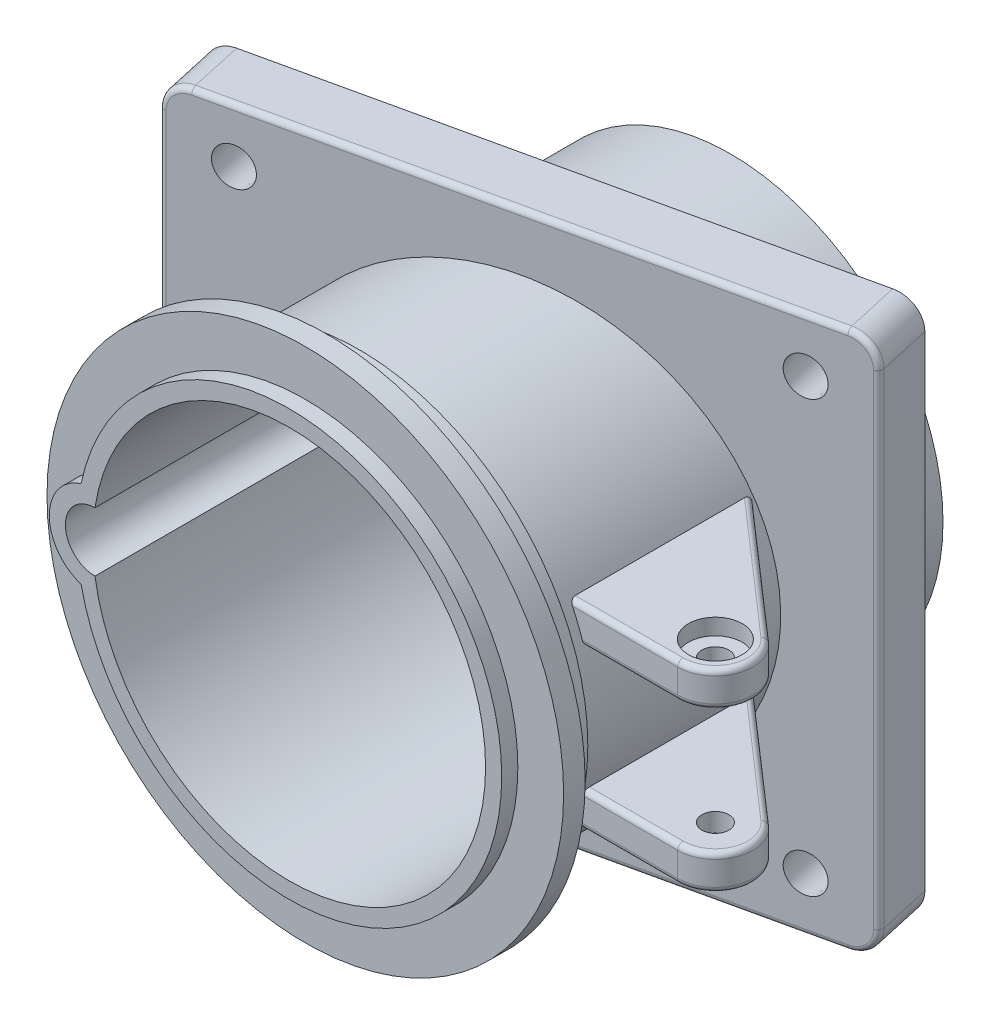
ISO-10303-21;
HEADER;
FILE_DESCRIPTION(('STEP AP214'),'2;1');
FILE_NAME('part.step','',(''),(''),'','','');
FILE_SCHEMA(('AUTOMOTIVE_DESIGN { 1 0 10303 214 1 1 1 1 }'));
ENDSEC;
DATA;
#1=APPLICATION_CONTEXT('core data for automotive mechanical design processes');
#2=APPLICATION_PROTOCOL_DEFINITION('international standard','automotive_design',2000,#1);
#3=PRODUCT_CONTEXT('',#1,'mechanical');
#4=PRODUCT('Part','Part','',(#3));
#5=PRODUCT_RELATED_PRODUCT_CATEGORY('part','',(#4));
#6=PRODUCT_DEFINITION_FORMATION('','',#4);
#7=PRODUCT_DEFINITION_CONTEXT('part definition',#1,'design');
#8=PRODUCT_DEFINITION('design','',#6,#7);
#9=PRODUCT_DEFINITION_SHAPE('','',#8);
#10=(LENGTH_UNIT() NAMED_UNIT(*) SI_UNIT(.MILLI.,.METRE.));
#11=(NAMED_UNIT(*) PLANE_ANGLE_UNIT() SI_UNIT($,.RADIAN.));
#12=(NAMED_UNIT(*) SI_UNIT($,.STERADIAN.) SOLID_ANGLE_UNIT());
#13=UNCERTAINTY_MEASURE_WITH_UNIT(LENGTH_MEASURE(1.E-05),#10,'distance_accuracy_value','');
#14=(GEOMETRIC_REPRESENTATION_CONTEXT(3) GLOBAL_UNCERTAINTY_ASSIGNED_CONTEXT((#13)) GLOBAL_UNIT_ASSIGNED_CONTEXT((#10,
#11,#12)) REPRESENTATION_CONTEXT('',''));
#15=CARTESIAN_POINT('',(0.,0.,0.));
#16=DIRECTION('',(0.,0.,1.));
#17=DIRECTION('',(1.,0.,0.));
#18=AXIS2_PLACEMENT_3D('',#15,#16,#17);
#19=CARTESIAN_POINT('',(0.,0.,82.));
#20=DIRECTION('',(0.,0.,-1.));
#21=DIRECTION('',(-1.,0.,0.));
#22=AXIS2_PLACEMENT_3D('',#19,#20,#21);
#23=CYLINDRICAL_SURFACE('',#22,39.5);
#24=CARTESIAN_POINT('',(0.,0.,0.));
#25=DIRECTION('',(0.,0.,1.));
#26=DIRECTION('',(1.,0.,0.));
#27=AXIS2_PLACEMENT_3D('',#24,#25,#26);
#28=CIRCLE('',#27,39.5);
#29=CARTESIAN_POINT('',(39.5,0.,0.));
#30=VERTEX_POINT('',#29);
#31=EDGE_CURVE('E456',#30,#30,#28,.T.);
#32=ORIENTED_EDGE('',*,*,#31,.T.);
#33=EDGE_LOOP('',(#32));
#34=FACE_BOUND('',#33,.T.);
#35=DIRECTION('',(0.,0.,1.));
#36=VECTOR('',#35,1.);
#37=CARTESIAN_POINT('',(-38.6611290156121,-8.09735161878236,41.));
#38=LINE('',#37,#36);
#39=CARTESIAN_POINT('',(-38.6611290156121,-8.09735161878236,36.3203802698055));
#40=VERTEX_POINT('',#39);
#41=CARTESIAN_POINT('',(-38.6611290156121,-8.09735161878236,5.49999999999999));
#42=VERTEX_POINT('',#41);
#43=EDGE_CURVE('E438',#40,#42,#38,.F.);
#44=ORIENTED_EDGE('',*,*,#43,.T.);
#45=CARTESIAN_POINT('',(-38.6611290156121,-8.09735161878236,5.49999999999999));
#46=CARTESIAN_POINT('',(-38.6611206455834,-8.0973880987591,5.47450232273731));
#47=CARTESIAN_POINT('',(-38.6615880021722,-8.09516017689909,5.44903209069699));
#48=CARTESIAN_POINT('',(-38.6634070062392,-8.08646974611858,5.3989621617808));
#49=CARTESIAN_POINT('',(-38.6647549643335,-8.08002490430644,5.3743592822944));
#50=CARTESIAN_POINT('',(-38.6682676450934,-8.0631970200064,5.3266341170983));
#51=CARTESIAN_POINT('',(-38.6704317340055,-8.0528170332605,5.30351069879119));
#52=CARTESIAN_POINT('',(-38.6754723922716,-8.02857329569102,5.25924426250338));
#53=CARTESIAN_POINT('',(-38.6783495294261,-8.01470676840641,5.23810284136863));
#54=CARTESIAN_POINT('',(-38.6848539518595,-7.9832539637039,5.19723126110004));
#55=CARTESIAN_POINT('',(-38.6885110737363,-7.96551877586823,5.17762092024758));
#56=CARTESIAN_POINT('',(-38.6963412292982,-7.92739266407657,5.14131765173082));
#57=CARTESIAN_POINT('',(-38.7005143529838,-7.90700127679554,5.12462523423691));
#58=CARTESIAN_POINT('',(-38.7097862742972,-7.86149147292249,5.09245278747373));
#59=CARTESIAN_POINT('',(-38.7149358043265,-7.83610010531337,5.07737390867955));
#60=CARTESIAN_POINT('',(-38.7255674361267,-7.7833895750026,5.05118751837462));
#61=CARTESIAN_POINT('',(-38.7310499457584,-7.75606804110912,5.04008499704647));
#62=CARTESIAN_POINT('',(-38.7429797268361,-7.69626963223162,5.02062960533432));
#63=CARTESIAN_POINT('',(-38.7494551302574,-7.66360422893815,5.0128738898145));
#64=CARTESIAN_POINT('',(-38.7624614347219,-7.59754875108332,5.00256257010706));
#65=CARTESIAN_POINT('',(-38.7689921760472,-7.56416049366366,4.99999517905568));
#66=CARTESIAN_POINT('',(-38.7754709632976,-7.53079355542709,4.99999999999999));
#67=B_SPLINE_CURVE_WITH_KNOTS('',3,(#45,#46,#47,#48,#49,#50,#51,#52,#53,#54,#55,#56,#57,#58,#59,
#60,#61,#62,#63,#64,#65,#66),.UNSPECIFIED.,.F.,.F.,(4,2,2,2,2,2,2,2,2,2,4),(0.,
0.0763485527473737,0.152379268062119,0.228351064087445,0.304383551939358,0.384139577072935,
0.463909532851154,0.55348349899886,0.643169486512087,0.745328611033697,0.847255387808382),.UNSPECIFIED.);
#68=CARTESIAN_POINT('',(-38.7754709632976,-7.53079355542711,4.99999999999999));
#69=VERTEX_POINT('',#68);
#70=EDGE_CURVE('E518',#42,#69,#67,.T.);
#71=ORIENTED_EDGE('',*,*,#70,.T.);
#72=CARTESIAN_POINT('',(0.,0.,4.99999999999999));
#73=DIRECTION('',(0.,0.,-1.));
#74=DIRECTION('',(-1.,0.,0.));
#75=AXIS2_PLACEMENT_3D('',#72,#73,#74);
#76=CIRCLE('',#75,39.5);
#77=CARTESIAN_POINT('',(-38.7754709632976,7.53079355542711,4.99999999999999));
#78=VERTEX_POINT('',#77);
#79=EDGE_CURVE('E503',#69,#78,#76,.T.);
#80=ORIENTED_EDGE('',*,*,#79,.T.);
#81=CARTESIAN_POINT('',(-38.7754709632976,7.53079355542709,4.99999999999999));
#82=CARTESIAN_POINT('',(-38.7673663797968,7.5725439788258,4.99998297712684));
#83=CARTESIAN_POINT('',(-38.7591705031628,7.6143636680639,5.00401332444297));
#84=CARTESIAN_POINT('',(-38.742901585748,7.69670490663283,5.02023518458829));
#85=CARTESIAN_POINT('',(-38.7348297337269,7.73721589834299,5.03248112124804));
#86=CARTESIAN_POINT('',(-38.7202879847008,7.80964105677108,5.06298712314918));
#87=CARTESIAN_POINT('',(-38.7137491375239,7.84197665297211,5.08020881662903));
#88=CARTESIAN_POINT('',(-38.7013905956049,7.90274119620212,5.12062364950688));
#89=CARTESIAN_POINT('',(-38.6955687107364,7.93118207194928,5.14379790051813));
#90=CARTESIAN_POINT('',(-38.6856027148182,7.97964183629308,5.19259372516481));
#91=CARTESIAN_POINT('',(-38.6813412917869,8.00026075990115,5.21759313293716));
#92=CARTESIAN_POINT('',(-38.6738854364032,8.03622569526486,5.27125839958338));
#93=CARTESIAN_POINT('',(-38.6706893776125,8.05157974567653,5.29991857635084));
#94=CARTESIAN_POINT('',(-38.6658662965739,8.07470803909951,5.35671741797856));
#95=CARTESIAN_POINT('',(-38.6641079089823,8.08311787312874,5.38458330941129));
#96=CARTESIAN_POINT('',(-38.6623302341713,8.09161470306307,5.42729785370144));
#97=CARTESIAN_POINT('',(-38.6618809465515,8.09376086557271,5.4417427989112));
#98=CARTESIAN_POINT('',(-38.6612800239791,8.09663065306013,5.47078864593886));
#99=CARTESIAN_POINT('',(-38.661128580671,8.09735336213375,5.48538964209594));
#100=CARTESIAN_POINT('',(-38.6611290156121,8.09735161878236,5.49999999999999));
#101=B_SPLINE_CURVE_WITH_KNOTS('',3,(#81,#82,#83,#84,#85,#86,#87,#88,#89,#90,#91,#92,#93,#94,
#95,#96,#97,#98,#99,#100),.UNSPECIFIED.,.F.,.F.,(4,2,2,2,2,2,2,2,2,4),(0.,0.127546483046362,
0.255946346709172,0.366967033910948,0.477639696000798,0.575103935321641,0.672418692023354,
0.759313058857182,0.803079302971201,0.846873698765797),.UNSPECIFIED.);
#102=CARTESIAN_POINT('',(-38.6611290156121,8.09735161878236,5.49999999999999));
#103=VERTEX_POINT('',#102);
#104=EDGE_CURVE('E511',#78,#103,#101,.T.);
#105=ORIENTED_EDGE('',*,*,#104,.T.);
#106=DIRECTION('',(0.,0.,1.));
#107=VECTOR('',#106,1.);
#108=CARTESIAN_POINT('',(-38.6611290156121,8.09735161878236,41.));
#109=LINE('',#108,#107);
#110=CARTESIAN_POINT('',(-38.6611290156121,8.09735161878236,36.3203802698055));
#111=VERTEX_POINT('',#110);
#112=EDGE_CURVE('E439',#103,#111,#109,.T.);
#113=ORIENTED_EDGE('',*,*,#112,.T.);
#114=CARTESIAN_POINT('',(0.,0.,27.6976347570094));
#115=DIRECTION('',(-0.217685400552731,0.,-0.976018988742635));
#116=DIRECTION('',(0.976018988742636,0.,-0.217685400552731));
#117=AXIS2_PLACEMENT_3D('',#114,#115,#116);
#118=ELLIPSE('',#117,40.470524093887,39.5);
#119=EDGE_CURVE('E350',#111,#40,#118,.T.);
#120=ORIENTED_EDGE('',*,*,#119,.T.);
#121=EDGE_LOOP('',(#44,#71,#80,#105,#113,#120));
#122=FACE_BOUND('',#121,.T.);
#123=ADVANCED_FACE('F35',(#34,#122),#23,.T.);
#124=CARTESIAN_POINT('',(0.,0.,0.));
#125=DIRECTION('',(0.,0.,1.));
#126=DIRECTION('',(1.,0.,0.));
#127=AXIS2_PLACEMENT_3D('',#124,#125,#126);
#128=PLANE('',#127);
#129=CARTESIAN_POINT('',(0.,-0.325530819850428,0.));
#130=DIRECTION('',(0.,0.,-1.));
#131=DIRECTION('',(-1.,0.,0.));
#132=AXIS2_PLACEMENT_3D('',#129,#130,#131);
#133=CIRCLE('',#132,31.);
#134=CARTESIAN_POINT('',(-31.,-0.325530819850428,0.));
#135=VERTEX_POINT('',#134);
#136=EDGE_CURVE('E359',#135,#135,#133,.T.);
#137=ORIENTED_EDGE('',*,*,#136,.F.);
#138=EDGE_LOOP('',(#137));
#139=FACE_BOUND('',#138,.T.);
#140=ORIENTED_EDGE('',*,*,#31,.F.);
#141=EDGE_LOOP('',(#140));
#142=FACE_BOUND('',#141,.T.);
#143=ADVANCED_FACE('F832',(#139,#142),#128,.F.);
#144=DIRECTION('',(0.,0.,-1.));
#145=VECTOR('',#144,1.);
#146=CARTESIAN_POINT('',(35.1603469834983,18.,82.));
#147=LINE('',#146,#145);
#148=CARTESIAN_POINT('',(35.1603469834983,18.,64.0000075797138));
#149=VERTEX_POINT('',#148);
#150=CARTESIAN_POINT('',(35.1603469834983,18.,32.538593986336));
#151=VERTEX_POINT('',#150);
#152=EDGE_CURVE('E392',#149,#151,#147,.T.);
#153=ORIENTED_EDGE('',*,*,#152,.T.);
#154=CARTESIAN_POINT('',(35.1603469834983,18.,32.538593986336));
#155=CARTESIAN_POINT('',(35.1603592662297,17.9999628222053,32.4697526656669));
#156=CARTESIAN_POINT('',(35.1624199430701,17.9959490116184,32.4004831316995));
#157=CARTESIAN_POINT('',(35.1715047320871,17.9781950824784,32.2627139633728));
#158=CARTESIAN_POINT('',(35.1785900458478,17.9643350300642,32.1942345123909));
#159=CARTESIAN_POINT('',(35.1955723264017,17.9310315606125,32.0817644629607));
#160=CARTESIAN_POINT('',(35.2039504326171,17.9145847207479,32.0366803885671));
#161=CARTESIAN_POINT('',(35.2237631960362,17.8755976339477,31.9501142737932));
#162=CARTESIAN_POINT('',(35.2351842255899,17.853084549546,31.9086172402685));
#163=CARTESIAN_POINT('',(35.2591368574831,17.8057252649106,31.8369081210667));
#164=CARTESIAN_POINT('',(35.2712163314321,17.7817927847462,31.8059457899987));
#165=CARTESIAN_POINT('',(35.2974903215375,17.7295806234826,31.7489153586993));
#166=CARTESIAN_POINT('',(35.3116852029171,17.7013001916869,31.7228481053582));
#167=CARTESIAN_POINT('',(35.3418951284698,17.6409066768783,31.6766405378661));
#168=CARTESIAN_POINT('',(35.3579162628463,17.6087807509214,31.6565209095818));
#169=CARTESIAN_POINT('',(35.3911936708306,17.5418016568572,31.6230389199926));
#170=CARTESIAN_POINT('',(35.4084492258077,17.5069500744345,31.609672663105));
#171=CARTESIAN_POINT('',(35.4426488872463,17.4376045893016,31.5903329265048));
#172=CARTESIAN_POINT('',(35.4595597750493,17.4031923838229,31.5840002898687));
#173=CARTESIAN_POINT('',(35.4935370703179,17.3337914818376,31.577139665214));
#174=CARTESIAN_POINT('',(35.5106037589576,17.2988015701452,31.576626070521));
#175=CARTESIAN_POINT('',(35.5495035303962,17.2187486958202,31.5815095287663));
#176=CARTESIAN_POINT('',(35.5712547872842,17.1737645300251,31.5886980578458));
#177=CARTESIAN_POINT('',(35.6137517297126,17.0854655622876,31.61048562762));
#178=CARTESIAN_POINT('',(35.6345028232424,17.0421421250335,31.6250383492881));
#179=CARTESIAN_POINT('',(35.6545929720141,17.,31.6426035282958));
#180=B_SPLINE_CURVE_WITH_KNOTS('',3,(#154,#155,#156,#157,#158,#159,#160,#161,#162,#163,#164,
#165,#166,#167,#168,#169,#170,#171,#172,#173,#174,#175,#176,#177,#178,#179),.UNSPECIFIED.,.F.,
.F.,(4,2,2,2,2,2,2,2,2,2,2,2,4),(0.,0.207076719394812,0.416720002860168,0.562357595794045,
0.707353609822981,0.829701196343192,0.95206993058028,1.07485938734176,1.19757793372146,
1.3136918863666,1.43009298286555,1.58089121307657,1.73075253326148),.UNSPECIFIED.);
#181=CARTESIAN_POINT('',(35.6545929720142,17.,31.6426035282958));
#182=VERTEX_POINT('',#181);
#183=EDGE_CURVE('E561',#151,#182,#180,.T.);
#184=ORIENTED_EDGE('',*,*,#183,.T.);
#185=CARTESIAN_POINT('',(0.,0.,0.512841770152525));
#186=DIRECTION('',(0.657690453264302,0.,-0.753288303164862));
#187=DIRECTION('',(-0.753288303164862,0.,-0.657690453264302));
#188=AXIS2_PLACEMENT_3D('',#185,#186,#187);
#189=ELLIPSE('',#188,52.4367627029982,39.5);
#190=CARTESIAN_POINT('',(37.4699879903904,12.5,33.2276115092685));
#191=VERTEX_POINT('',#190);
#192=EDGE_CURVE('E405',#182,#191,#189,.T.);
#193=ORIENTED_EDGE('',*,*,#192,.T.);
#194=CARTESIAN_POINT('',(37.4699879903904,12.5,33.2276115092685));
#195=CARTESIAN_POINT('',(37.4902097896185,12.4393877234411,33.2453239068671));
#196=CARTESIAN_POINT('',(37.5095851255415,12.3808138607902,33.2694809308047));
#197=CARTESIAN_POINT('',(37.5463054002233,12.2689994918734,33.327961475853));
#198=CARTESIAN_POINT('',(37.5636680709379,12.2157131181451,33.3621850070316));
#199=CARTESIAN_POINT('',(37.6009078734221,12.1006753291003,33.4489682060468));
#200=CARTESIAN_POINT('',(37.6201702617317,12.0406055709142,33.5039825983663));
#201=CARTESIAN_POINT('',(37.6555971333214,11.9293515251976,33.6236153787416));
#202=CARTESIAN_POINT('',(37.6717450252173,11.8782149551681,33.6882821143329));
#203=CARTESIAN_POINT('',(37.7045518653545,11.7737198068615,33.8415354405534));
#204=CARTESIAN_POINT('',(37.7203439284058,11.7229567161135,33.9320763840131));
#205=CARTESIAN_POINT('',(37.7471558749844,11.6363342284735,34.1204591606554));
#206=CARTESIAN_POINT('',(37.7581818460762,11.6004558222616,34.2182914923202));
#207=CARTESIAN_POINT('',(37.7739771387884,11.5489067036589,34.4020897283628));
#208=CARTESIAN_POINT('',(37.7794813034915,11.5308699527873,34.4873290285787));
#209=CARTESIAN_POINT('',(37.785070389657,11.5125363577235,34.6164706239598));
#210=CARTESIAN_POINT('',(37.7864888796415,11.5078787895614,34.6597254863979));
#211=CARTESIAN_POINT('',(37.7883964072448,11.5016130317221,34.7464967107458));
#212=CARTESIAN_POINT('',(37.7888849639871,11.5000064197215,34.7900131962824));
#213=CARTESIAN_POINT('',(37.7888872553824,11.5,34.8335530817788));
#214=B_SPLINE_CURVE_WITH_KNOTS('',3,(#194,#195,#196,#197,#198,#199,#200,#201,#202,#203,#204,
#205,#206,#207,#208,#209,#210,#211,#212,#213),.UNSPECIFIED.,.F.,.F.,(4,2,2,2,2,2,2,2,2,4),(0.,
0.197985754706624,0.394067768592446,0.643881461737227,0.894991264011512,1.20839194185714,
1.52139113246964,1.78242390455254,1.91290397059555,2.04345149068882),.UNSPECIFIED.);
#215=CARTESIAN_POINT('',(37.7888872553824,11.5,34.8335530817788));
#216=VERTEX_POINT('',#215);
#217=EDGE_CURVE('E547',#191,#216,#214,.T.);
#218=ORIENTED_EDGE('',*,*,#217,.T.);
#219=DIRECTION('',(0.,0.,1.));
#220=VECTOR('',#219,1.);
#221=CARTESIAN_POINT('',(37.7888872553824,11.5,21.0000075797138));
#222=LINE('',#221,#220);
#223=CARTESIAN_POINT('',(37.7888872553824,11.5,64.0000075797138));
#224=VERTEX_POINT('',#223);
#225=EDGE_CURVE('E382',#216,#224,#222,.T.);
#226=ORIENTED_EDGE('',*,*,#225,.T.);
#227=CARTESIAN_POINT('',(37.7888872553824,11.5,64.0000075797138));
#228=CARTESIAN_POINT('',(37.7888872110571,11.4999995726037,64.0272374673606));
#229=CARTESIAN_POINT('',(37.7885485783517,11.501112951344,64.0544540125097));
#230=CARTESIAN_POINT('',(37.7871977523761,11.505550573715,64.1086859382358));
#231=CARTESIAN_POINT('',(37.7861856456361,11.5088745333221,64.135701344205));
#232=CARTESIAN_POINT('',(37.7821518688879,11.5221131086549,64.2160460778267));
#233=CARTESIAN_POINT('',(37.7781326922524,11.5352946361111,64.2688266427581));
#234=CARTESIAN_POINT('',(37.7675457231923,11.5699098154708,64.3713055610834));
#235=CARTESIAN_POINT('',(37.7609777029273,11.5913442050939,64.4210036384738));
#236=CARTESIAN_POINT('',(37.7454717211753,11.6417377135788,64.5160283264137));
#237=CARTESIAN_POINT('',(37.7365334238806,11.6706978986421,64.5613543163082));
#238=CARTESIAN_POINT('',(37.7163474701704,11.7357705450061,64.6472377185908));
#239=CARTESIAN_POINT('',(37.7050624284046,11.7719984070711,64.6876987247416));
#240=CARTESIAN_POINT('',(37.6805714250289,11.8501566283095,64.7619864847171));
#241=CARTESIAN_POINT('',(37.6673650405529,11.8920882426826,64.7958117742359));
#242=CARTESIAN_POINT('',(37.6387749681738,11.9822762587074,64.8573669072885));
#243=CARTESIAN_POINT('',(37.6233238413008,12.030722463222,64.8847869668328));
#244=CARTESIAN_POINT('',(37.5910746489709,12.131112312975,64.9311244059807));
#245=CARTESIAN_POINT('',(37.5742763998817,12.1830564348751,64.9500406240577));
#246=CARTESIAN_POINT('',(37.5429644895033,12.2791640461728,64.9763434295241));
#247=CARTESIAN_POINT('',(37.5286067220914,12.3229786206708,64.9852197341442));
#248=CARTESIAN_POINT('',(37.4995230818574,12.4112029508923,64.9970518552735));
#249=CARTESIAN_POINT('',(37.4847978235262,12.455611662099,65.0000169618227));
#250=CARTESIAN_POINT('',(37.4699879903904,12.5,65.0000075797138));
#251=B_SPLINE_CURVE_WITH_KNOTS('',3,(#227,#228,#229,#230,#231,#232,#233,#234,#235,#236,#237,
#238,#239,#240,#241,#242,#243,#244,#245,#246,#247,#248,#249,#250),.UNSPECIFIED.,.F.,.F.,(4,2,2,
2,2,2,2,2,2,2,2,4),(0.,0.0816384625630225,0.163266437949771,0.326070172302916,0.488888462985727,
0.651729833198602,0.817397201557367,0.983101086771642,1.15565500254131,1.32823248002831,
1.46872470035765,1.60899594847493),.UNSPECIFIED.);
#252=CARTESIAN_POINT('',(37.4699879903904,12.5,65.0000075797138));
#253=VERTEX_POINT('',#252);
#254=EDGE_CURVE('E591',#224,#253,#251,.T.);
#255=ORIENTED_EDGE('',*,*,#254,.T.);
#256=CARTESIAN_POINT('',(0.,0.,65.0000075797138));
#257=DIRECTION('',(0.,0.,1.));
#258=DIRECTION('',(1.,0.,0.));
#259=AXIS2_PLACEMENT_3D('',#256,#257,#258);
#260=CIRCLE('',#259,39.5);
#261=CARTESIAN_POINT('',(35.6545929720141,17.,65.0000075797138));
#262=VERTEX_POINT('',#261);
#263=EDGE_CURVE('E409',#253,#262,#260,.T.);
#264=ORIENTED_EDGE('',*,*,#263,.T.);
#265=CARTESIAN_POINT('',(35.6545929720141,17.,65.0000075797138));
#266=CARTESIAN_POINT('',(35.6252860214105,17.0614822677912,65.000025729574));
#267=CARTESIAN_POINT('',(35.5958014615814,17.1228962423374,64.994337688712));
#268=CARTESIAN_POINT('',(35.5372738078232,17.2440297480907,64.9717306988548));
#269=CARTESIAN_POINT('',(35.5082319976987,17.3037446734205,64.9547837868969));
#270=CARTESIAN_POINT('',(35.4515049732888,17.4196729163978,64.9098136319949));
#271=CARTESIAN_POINT('',(35.4238215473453,17.475881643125,64.8817762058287));
#272=CARTESIAN_POINT('',(35.3708665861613,17.582813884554,64.815048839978));
#273=CARTESIAN_POINT('',(35.3455927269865,17.633542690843,64.7763693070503));
#274=CARTESIAN_POINT('',(35.2997655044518,17.7250965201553,64.6913347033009));
#275=CARTESIAN_POINT('',(35.2790347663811,17.7662999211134,64.6454847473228));
#276=CARTESIAN_POINT('',(35.2417333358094,17.8401779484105,64.5458443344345));
#277=CARTESIAN_POINT('',(35.2251610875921,17.8728557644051,64.4920568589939));
#278=CARTESIAN_POINT('',(35.1987104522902,17.9248861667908,64.3844112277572));
#279=CARTESIAN_POINT('',(35.1883004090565,17.9453007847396,64.3311957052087));
#280=CARTESIAN_POINT('',(35.1722030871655,17.9768309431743,64.221458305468));
#281=CARTESIAN_POINT('',(35.1665042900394,17.98796916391,64.1649448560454));
#282=CARTESIAN_POINT('',(35.1623373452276,17.9961116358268,64.0899479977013));
#283=CARTESIAN_POINT('',(35.1615910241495,17.9975697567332,64.0719857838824));
#284=CARTESIAN_POINT('',(35.1605965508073,17.9995125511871,64.0360213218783));
#285=CARTESIAN_POINT('',(35.1603476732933,17.9999986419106,64.018019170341));
#286=CARTESIAN_POINT('',(35.1603469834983,18.,64.0000075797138));
#287=B_SPLINE_CURVE_WITH_KNOTS('',3,(#265,#266,#267,#268,#269,#270,#271,#272,#273,#274,#275,
#276,#277,#278,#279,#280,#281,#282,#283,#284,#285,#286),.UNSPECIFIED.,.F.,.F.,(4,2,2,2,2,2,2,2,
2,2,4),(0.,0.204122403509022,0.408753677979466,0.613647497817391,0.81834166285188,
1.01236728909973,1.20632022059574,1.37920012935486,1.55165610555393,1.60574271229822,
1.65975040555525),.UNSPECIFIED.);
#288=EDGE_CURVE('E44',#262,#149,#287,.T.);
#289=ORIENTED_EDGE('',*,*,#288,.T.);
#290=EDGE_LOOP('',(#153,#184,#193,#218,#226,#255,#264,#289));
#291=FACE_BOUND('',#290,.T.);
#292=DIRECTION('',(0.,0.,1.));
#293=VECTOR('',#292,1.);
#294=CARTESIAN_POINT('',(37.7888872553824,-11.5,21.0000075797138));
#295=LINE('',#294,#293);
#296=CARTESIAN_POINT('',(37.7888872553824,-11.5,34.8335530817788));
#297=VERTEX_POINT('',#296);
#298=CARTESIAN_POINT('',(37.7888872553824,-11.5,64.0000075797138));
#299=VERTEX_POINT('',#298);
#300=EDGE_CURVE('E384',#297,#299,#295,.T.);
#301=ORIENTED_EDGE('',*,*,#300,.F.);
#302=CARTESIAN_POINT('',(37.7888872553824,-11.5,34.8335530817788));
#303=CARTESIAN_POINT('',(37.7888852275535,-11.5000056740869,34.7913141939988));
#304=CARTESIAN_POINT('',(37.788425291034,-11.5015181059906,34.7490963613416));
#305=CARTESIAN_POINT('',(37.7866284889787,-11.507420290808,34.6649006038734));
#306=CARTESIAN_POINT('',(37.7852920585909,-11.5118086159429,34.6229225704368));
#307=CARTESIAN_POINT('',(37.7800254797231,-11.5290860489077,34.4975790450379));
#308=CARTESIAN_POINT('',(37.7748380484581,-11.5460875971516,34.4148067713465));
#309=CARTESIAN_POINT('',(37.7598542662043,-11.5950075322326,34.2349808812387));
#310=CARTESIAN_POINT('',(37.7493112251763,-11.6293329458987,34.138643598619));
#311=CARTESIAN_POINT('',(37.7236421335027,-11.7123317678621,33.9527844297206));
#312=CARTESIAN_POINT('',(37.7085096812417,-11.7610252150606,33.863272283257));
#313=CARTESIAN_POINT('',(37.6768334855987,-11.8620600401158,33.7101026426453));
#314=CARTESIAN_POINT('',(37.6610734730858,-11.9120453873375,33.6447305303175));
#315=CARTESIAN_POINT('',(37.6264470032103,-12.0209707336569,33.523322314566));
#316=CARTESIAN_POINT('',(37.6075963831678,-12.0798649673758,33.4672414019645));
#317=CARTESIAN_POINT('',(37.5698979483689,-12.1965528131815,33.3751695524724));
#318=CARTESIAN_POINT('',(37.5515128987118,-12.2530717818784,33.3374074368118));
#319=CARTESIAN_POINT('',(37.5222464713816,-12.3422855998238,33.2892272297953));
#320=CARTESIAN_POINT('',(37.5121500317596,-12.3729414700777,33.2745213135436));
#321=CARTESIAN_POINT('',(37.4914408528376,-12.4355521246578,33.2484429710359));
#322=CARTESIAN_POINT('',(37.4808270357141,-12.4675095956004,33.2370778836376));
#323=CARTESIAN_POINT('',(37.4699879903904,-12.5,33.2276115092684));
#324=B_SPLINE_CURVE_WITH_KNOTS('',3,(#302,#303,#304,#305,#306,#307,#308,#309,#310,#311,#312,
#313,#314,#315,#316,#317,#318,#319,#320,#321,#322,#323),.UNSPECIFIED.,.F.,.F.,(4,2,2,2,2,2,2,2,
2,2,4),(0.,0.126651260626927,0.253239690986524,0.506424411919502,0.813573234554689,
1.12115247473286,1.37162215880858,1.62084631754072,1.83100313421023,1.93724128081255,
2.04371108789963),.UNSPECIFIED.);
#325=CARTESIAN_POINT('',(37.4699879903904,-12.5,33.2276115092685));
#326=VERTEX_POINT('',#325);
#327=EDGE_CURVE('E553',#297,#326,#324,.T.);
#328=ORIENTED_EDGE('',*,*,#327,.T.);
#329=CARTESIAN_POINT('',(35.6545929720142,-17.,31.6426035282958));
#330=VERTEX_POINT('',#329);
#331=EDGE_CURVE('E402',#326,#330,#189,.T.);
#332=ORIENTED_EDGE('',*,*,#331,.T.);
#333=CARTESIAN_POINT('',(35.6545929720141,-17.,31.6426035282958));
#334=CARTESIAN_POINT('',(35.6346602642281,-17.0418111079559,31.6251854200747));
#335=CARTESIAN_POINT('',(35.6140907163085,-17.0847574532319,31.6107276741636));
#336=CARTESIAN_POINT('',(35.571852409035,-17.1725264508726,31.5889372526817));
#337=CARTESIAN_POINT('',(35.5501735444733,-17.2173652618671,31.5816906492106));
#338=CARTESIAN_POINT('',(35.5062228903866,-17.3078215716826,31.5759816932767));
#339=CARTESIAN_POINT('',(35.4839479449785,-17.3534423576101,31.5775833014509));
#340=CARTESIAN_POINT('',(35.4399035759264,-17.4432138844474,31.5909130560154));
#341=CARTESIAN_POINT('',(35.4181320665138,-17.4873712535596,31.6025862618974));
#342=CARTESIAN_POINT('',(35.3791565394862,-17.5660732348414,31.6338209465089));
#343=CARTESIAN_POINT('',(35.3617508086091,-17.601078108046,31.6519752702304));
#344=CARTESIAN_POINT('',(35.328660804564,-17.6674022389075,31.6953140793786));
#345=CARTESIAN_POINT('',(35.3129779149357,-17.6987185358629,31.7205041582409));
#346=CARTESIAN_POINT('',(35.2852634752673,-17.7539022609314,31.7740238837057));
#347=CARTESIAN_POINT('',(35.2730253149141,-17.7781975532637,31.8018121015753));
#348=CARTESIAN_POINT('',(35.2505442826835,-17.8227312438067,31.8611348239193));
#349=CARTESIAN_POINT('',(35.2403007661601,-17.8429709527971,31.8926681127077));
#350=CARTESIAN_POINT('',(35.2181076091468,-17.8867472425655,31.9717582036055));
#351=CARTESIAN_POINT('',(35.2071266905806,-17.9083399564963,32.0206617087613));
#352=CARTESIAN_POINT('',(35.1888342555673,-17.9442566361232,32.1218513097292));
#353=CARTESIAN_POINT('',(35.1815386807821,-17.9585490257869,32.1741510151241));
#354=CARTESIAN_POINT('',(35.1704633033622,-17.9802297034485,32.2784839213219));
#355=CARTESIAN_POINT('',(35.166566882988,-17.9878470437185,32.3304595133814));
#356=CARTESIAN_POINT('',(35.1615266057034,-17.9976954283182,32.4345262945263));
#357=CARTESIAN_POINT('',(35.1603548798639,-17.9999810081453,32.4866108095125));
#358=CARTESIAN_POINT('',(35.1603469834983,-18.,32.538593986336));
#359=B_SPLINE_CURVE_WITH_KNOTS('',3,(#333,#334,#335,#336,#337,#338,#339,#340,#341,#342,#343,
#344,#345,#346,#347,#348,#349,#350,#351,#352,#353,#354,#355,#356,#357,#358),.UNSPECIFIED.,.F.,
.F.,(4,2,2,2,2,2,2,2,2,2,2,2,4),(0.,0.148621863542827,0.298997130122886,0.450460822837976,
0.601103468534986,0.729663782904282,0.858326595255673,0.974511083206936,1.09065795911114,
1.25348147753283,1.41700341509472,1.5746656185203,1.73070797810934),.UNSPECIFIED.);
#360=CARTESIAN_POINT('',(35.1603469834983,-18.,32.538593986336));
#361=VERTEX_POINT('',#360);
#362=EDGE_CURVE('E615',#330,#361,#359,.T.);
#363=ORIENTED_EDGE('',*,*,#362,.T.);
#364=DIRECTION('',(0.,0.,-1.));
#365=VECTOR('',#364,1.);
#366=CARTESIAN_POINT('',(35.1603469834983,-18.,82.));
#367=LINE('',#366,#365);
#368=CARTESIAN_POINT('',(35.1603469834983,-18.,64.0000075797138));
#369=VERTEX_POINT('',#368);
#370=EDGE_CURVE('E399',#369,#361,#367,.T.);
#371=ORIENTED_EDGE('',*,*,#370,.F.);
#372=CARTESIAN_POINT('',(35.1603469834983,-18.,64.0000075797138));
#373=CARTESIAN_POINT('',(35.1603461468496,-18.0000012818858,64.0259646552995));
#374=CARTESIAN_POINT('',(35.1608647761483,-17.99898860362,64.0519083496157));
#375=CARTESIAN_POINT('',(35.1629276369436,-17.9949583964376,64.1035910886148));
#376=CARTESIAN_POINT('',(35.1644715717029,-17.9919414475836,64.1293301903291));
#377=CARTESIAN_POINT('',(35.1706028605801,-17.9799549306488,64.2057603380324));
#378=CARTESIAN_POINT('',(35.1766899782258,-17.9680491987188,64.2559071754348));
#379=CARTESIAN_POINT('',(35.1925572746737,-17.9369510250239,64.3531844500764));
#380=CARTESIAN_POINT('',(35.2023349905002,-17.9177634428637,64.4003168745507));
#381=CARTESIAN_POINT('',(35.2251455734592,-17.8728775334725,64.490543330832));
#382=CARTESIAN_POINT('',(35.2381807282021,-17.8471746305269,64.5336344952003));
#383=CARTESIAN_POINT('',(35.2676451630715,-17.7888817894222,64.6167390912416));
#384=CARTESIAN_POINT('',(35.2842013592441,-17.7560327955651,64.6565249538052));
#385=CARTESIAN_POINT('',(35.3197126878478,-17.6852894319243,64.7300652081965));
#386=CARTESIAN_POINT('',(35.3386684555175,-17.6473937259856,64.7638179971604));
#387=CARTESIAN_POINT('',(35.3804825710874,-17.5634241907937,64.828034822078));
#388=CARTESIAN_POINT('',(35.4035417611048,-17.5169097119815,64.8577915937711));
#389=CARTESIAN_POINT('',(35.4512037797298,-17.4202486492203,64.909066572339));
#390=CARTESIAN_POINT('',(35.4758076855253,-17.3700995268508,64.9305789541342));
#391=CARTESIAN_POINT('',(35.5259891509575,-17.267233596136,64.9651699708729));
#392=CARTESIAN_POINT('',(35.5515695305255,-17.214509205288,64.9782218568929));
#393=CARTESIAN_POINT('',(35.6030088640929,-17.1078737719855,64.9956396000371));
#394=CARTESIAN_POINT('',(35.6288673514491,-17.0539645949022,65.0000182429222));
#395=CARTESIAN_POINT('',(35.6545929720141,-17.,65.0000075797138));
#396=B_SPLINE_CURVE_WITH_KNOTS('',3,(#372,#373,#374,#375,#376,#377,#378,#379,#380,#381,#382,
#383,#384,#385,#386,#387,#388,#389,#390,#391,#392,#393,#394,#395),.UNSPECIFIED.,.F.,.F.,(4,2,2,
2,2,2,2,2,2,2,2,4),(0.,0.0778201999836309,0.15561788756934,0.310494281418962,0.465267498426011,
0.620149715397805,0.782041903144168,0.943977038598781,1.12275600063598,1.30166104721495,
1.48112900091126,1.66033219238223),.UNSPECIFIED.);
#397=CARTESIAN_POINT('',(35.6545929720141,-17.,65.0000075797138));
#398=VERTEX_POINT('',#397);
#399=EDGE_CURVE('E11',#369,#398,#396,.T.);
#400=ORIENTED_EDGE('',*,*,#399,.T.);
#401=CARTESIAN_POINT('',(37.4699879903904,-12.5,65.0000075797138));
#402=VERTEX_POINT('',#401);
#403=EDGE_CURVE('E406',#398,#402,#260,.T.);
#404=ORIENTED_EDGE('',*,*,#403,.T.);
#405=CARTESIAN_POINT('',(37.4699879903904,-12.5,65.0000075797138));
#406=CARTESIAN_POINT('',(37.4894121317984,-12.4417918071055,65.0000462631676));
#407=CARTESIAN_POINT('',(37.5086938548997,-12.3835239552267,64.9949265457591));
#408=CARTESIAN_POINT('',(37.5464837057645,-12.2684601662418,64.9745771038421));
#409=CARTESIAN_POINT('',(37.5649910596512,-12.2116657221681,64.9593375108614));
#410=CARTESIAN_POINT('',(37.6007247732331,-12.1011943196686,64.9189318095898));
#411=CARTESIAN_POINT('',(37.6179495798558,-12.0475211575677,64.8937538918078));
#412=CARTESIAN_POINT('',(37.6505979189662,-11.9450976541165,64.834029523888));
#413=CARTESIAN_POINT('',(37.6660227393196,-11.8963437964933,64.7994898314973));
#414=CARTESIAN_POINT('',(37.6942059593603,-11.8067347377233,64.7230225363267));
#415=CARTESIAN_POINT('',(37.7070294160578,-11.7656894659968,64.6813419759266));
#416=CARTESIAN_POINT('',(37.7301854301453,-11.6912203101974,64.5910224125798));
#417=CARTESIAN_POINT('',(37.7405177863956,-11.657797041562,64.542382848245));
#418=CARTESIAN_POINT('',(37.7579464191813,-11.6012206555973,64.4420041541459));
#419=CARTESIAN_POINT('',(37.7651714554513,-11.5776602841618,64.390516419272));
#420=CARTESIAN_POINT('',(37.776840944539,-11.5395273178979,64.284048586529));
#421=CARTESIAN_POINT('',(37.7812889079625,-11.5249433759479,64.2290729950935));
#422=CARTESIAN_POINT('',(37.7858156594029,-11.5100894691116,64.1446563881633));
#423=CARTESIAN_POINT('',(37.7869673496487,-11.5063073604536,64.1158470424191));
#424=CARTESIAN_POINT('',(37.7885025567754,-11.5012641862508,64.0580326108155));
#425=CARTESIAN_POINT('',(37.7888872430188,-11.4999992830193,64.0290278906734));
#426=CARTESIAN_POINT('',(37.7888872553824,-11.5,64.0000075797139));
#427=B_SPLINE_CURVE_WITH_KNOTS('',3,(#405,#406,#407,#408,#409,#410,#411,#412,#413,#414,#415,
#416,#417,#418,#419,#420,#421,#422,#423,#424,#425,#426),.UNSPECIFIED.,.F.,.F.,(4,2,2,2,2,2,2,2,
2,2,4),(0.,0.183897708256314,0.367975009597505,0.552271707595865,0.736435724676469,
0.915185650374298,1.0939500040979,1.26435279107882,1.43453972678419,1.52167280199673,
1.6086729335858),.UNSPECIFIED.);
#428=EDGE_CURVE('E585',#402,#299,#427,.T.);
#429=ORIENTED_EDGE('',*,*,#428,.T.);
#430=EDGE_LOOP('',(#301,#328,#332,#363,#371,#400,#404,#429));
#431=FACE_BOUND('',#430,.T.);
#432=CARTESIAN_POINT('',(-38.6611290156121,-8.09735161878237,69.));
#433=VERTEX_POINT('',#432);
#434=CARTESIAN_POINT('',(-38.6611290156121,-8.09735161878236,47.5906528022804));
#435=VERTEX_POINT('',#434);
#436=EDGE_CURVE('E434',#433,#435,#38,.F.);
#437=ORIENTED_EDGE('',*,*,#436,.T.);
#438=CARTESIAN_POINT('',(0.,0.,38.9679072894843));
#439=DIRECTION('',(0.217685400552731,0.,0.976018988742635));
#440=DIRECTION('',(0.976018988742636,0.,-0.217685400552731));
#441=AXIS2_PLACEMENT_3D('',#438,#439,#440);
#442=ELLIPSE('',#441,40.470524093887,39.5);
#443=CARTESIAN_POINT('',(-38.6611290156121,8.09735161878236,47.5906528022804));
#444=VERTEX_POINT('',#443);
#445=EDGE_CURVE('E356',#435,#444,#442,.T.);
#446=ORIENTED_EDGE('',*,*,#445,.T.);
#447=CARTESIAN_POINT('',(-38.6611290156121,8.09735161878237,69.));
#448=VERTEX_POINT('',#447);
#449=EDGE_CURVE('E437',#444,#448,#109,.T.);
#450=ORIENTED_EDGE('',*,*,#449,.T.);
#451=CARTESIAN_POINT('',(0.,0.,69.));
#452=DIRECTION('',(0.,0.,1.));
#453=DIRECTION('',(1.,0.,0.));
#454=AXIS2_PLACEMENT_3D('',#451,#452,#453);
#455=CIRCLE('',#454,39.5);
#456=EDGE_CURVE('E455',#433,#448,#455,.T.);
#457=ORIENTED_EDGE('',*,*,#456,.F.);
#458=EDGE_LOOP('',(#437,#446,#450,#457));
#459=FACE_BOUND('',#458,.T.);
#460=ADVANCED_FACE('F523',(#291,#431,#459),#23,.T.);
#461=CARTESIAN_POINT('',(-36.0759990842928,0.,-19.2705263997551));
#462=DIRECTION('',(0.,0.,1.));
#463=DIRECTION('',(1.,0.,0.));
#464=AXIS2_PLACEMENT_3D('',#461,#462,#463);
#465=CYLINDRICAL_SURFACE('',#464,8.5);
#466=CARTESIAN_POINT('',(-36.0759990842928,0.,47.014080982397));
#467=DIRECTION('',(0.217685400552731,0.,0.976018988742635));
#468=DIRECTION('',(-0.976018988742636,0.,0.217685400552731));
#469=AXIS2_PLACEMENT_3D('',#466,#467,#468);
#470=ELLIPSE('',#469,8.70884695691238,8.5);
#471=EDGE_CURVE('E353',#435,#444,#470,.F.);
#472=ORIENTED_EDGE('',*,*,#471,.F.);
#473=ORIENTED_EDGE('',*,*,#436,.F.);
#474=CARTESIAN_POINT('',(-36.0759990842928,0.,69.));
#475=DIRECTION('',(0.,0.,1.));
#476=DIRECTION('',(1.,0.,0.));
#477=AXIS2_PLACEMENT_3D('',#474,#475,#476);
#478=CIRCLE('',#477,8.5);
#479=CARTESIAN_POINT('',(-42.0705980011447,-6.02617489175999,69.));
#480=VERTEX_POINT('',#479);
#481=EDGE_CURVE('E430',#480,#433,#478,.T.);
#482=ORIENTED_EDGE('',*,*,#481,.F.);
#483=DIRECTION('',(0.,0.,1.));
#484=VECTOR('',#483,1.);
#485=CARTESIAN_POINT('',(-42.0705980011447,-6.02617489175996,72.));
#486=LINE('',#485,#484);
#487=CARTESIAN_POINT('',(-42.0705980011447,-6.02617489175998,75.));
#488=VERTEX_POINT('',#487);
#489=EDGE_CURVE('E424',#488,#480,#486,.F.);
#490=ORIENTED_EDGE('',*,*,#489,.F.);
#491=CARTESIAN_POINT('',(-36.0759990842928,0.,75.));
#492=DIRECTION('',(0.,0.,1.));
#493=DIRECTION('',(1.,0.,0.));
#494=AXIS2_PLACEMENT_3D('',#491,#492,#493);
#495=CIRCLE('',#494,8.5);
#496=CARTESIAN_POINT('',(-42.0705980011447,6.02617489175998,75.));
#497=VERTEX_POINT('',#496);
#498=EDGE_CURVE('E421',#497,#488,#495,.T.);
#499=ORIENTED_EDGE('',*,*,#498,.F.);
#500=DIRECTION('',(0.,0.,1.));
#501=VECTOR('',#500,1.);
#502=CARTESIAN_POINT('',(-42.0705980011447,6.02617489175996,72.));
#503=LINE('',#502,#501);
#504=CARTESIAN_POINT('',(-42.0705980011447,6.02617489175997,69.));
#505=VERTEX_POINT('',#504);
#506=EDGE_CURVE('E427',#505,#497,#503,.T.);
#507=ORIENTED_EDGE('',*,*,#506,.F.);
#508=EDGE_CURVE('E433',#448,#505,#478,.T.);
#509=ORIENTED_EDGE('',*,*,#508,.F.);
#510=ORIENTED_EDGE('',*,*,#449,.F.);
#511=EDGE_LOOP('',(#472,#473,#482,#490,#499,#507,#509,#510));
#512=FACE_BOUND('',#511,.T.);
#513=ADVANCED_FACE('F845',(#512),#465,.T.);
#514=CARTESIAN_POINT('',(55.1998225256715,26.,58.));
#515=DIRECTION('',(0.,-1.,0.));
#516=DIRECTION('',(0.,0.,-1.));
#517=AXIS2_PLACEMENT_3D('',#514,#515,#516);
#518=CYLINDRICAL_SURFACE('',#517,2.5);
#519=CARTESIAN_POINT('',(55.1998225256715,11.5,58.));
#520=DIRECTION('',(0.,1.,0.));
#521=DIRECTION('',(0.,0.,1.));
#522=AXIS2_PLACEMENT_3D('',#519,#520,#521);
#523=CIRCLE('',#522,2.5);
#524=CARTESIAN_POINT('',(55.1998225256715,11.5,60.5));
#525=VERTEX_POINT('',#524);
#526=EDGE_CURVE('E383',#525,#525,#523,.T.);
#527=ORIENTED_EDGE('',*,*,#526,.F.);
#528=EDGE_LOOP('',(#527));
#529=FACE_BOUND('',#528,.T.);
#530=CARTESIAN_POINT('',(55.1998225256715,15.,58.));
#531=DIRECTION('',(0.,1.,0.));
#532=DIRECTION('',(0.,0.,1.));
#533=AXIS2_PLACEMENT_3D('',#530,#531,#532);
#534=CIRCLE('',#533,2.5);
#535=CARTESIAN_POINT('',(55.1998225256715,15.,60.5));
#536=VERTEX_POINT('',#535);
#537=EDGE_CURVE('E369',#536,#536,#534,.F.);
#538=ORIENTED_EDGE('',*,*,#537,.F.);
#539=EDGE_LOOP('',(#538));
#540=FACE_BOUND('',#539,.T.);
#541=ADVANCED_FACE('F849',(#529,#540),#518,.F.);
#542=CARTESIAN_POINT('',(55.1998225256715,-11.5,58.));
#543=DIRECTION('',(0.,-1.,0.));
#544=DIRECTION('',(0.,0.,-1.));
#545=AXIS2_PLACEMENT_3D('',#542,#543,#544);
#546=CIRCLE('',#545,2.5);
#547=CARTESIAN_POINT('',(55.1998225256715,-11.5,55.5));
#548=VERTEX_POINT('',#547);
#549=EDGE_CURVE('E379',#548,#548,#546,.T.);
#550=ORIENTED_EDGE('',*,*,#549,.F.);
#551=EDGE_LOOP('',(#550));
#552=FACE_BOUND('',#551,.T.);
#553=CARTESIAN_POINT('',(55.1998225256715,-15.,58.));
#554=DIRECTION('',(0.,-1.,0.));
#555=DIRECTION('',(0.,0.,-1.));
#556=AXIS2_PLACEMENT_3D('',#553,#554,#555);
#557=CIRCLE('',#556,2.5);
#558=CARTESIAN_POINT('',(55.1998225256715,-15.,55.5));
#559=VERTEX_POINT('',#558);
#560=EDGE_CURVE('E375',#559,#559,#557,.F.);
#561=ORIENTED_EDGE('',*,*,#560,.F.);
#562=EDGE_LOOP('',(#561));
#563=FACE_BOUND('',#562,.T.);
#564=ADVANCED_FACE('F857',(#552,#563),#518,.F.);
#565=CARTESIAN_POINT('',(55.1998225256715,-18.,65.0000075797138));
#566=DIRECTION('',(0.,0.,1.));
#567=DIRECTION('',(1.,0.,0.));
#568=AXIS2_PLACEMENT_3D('',#565,#566,#567);
#569=PLANE('',#568);
#570=DIRECTION('',(0.,1.,0.));
#571=VECTOR('',#570,1.);
#572=CARTESIAN_POINT('',(55.1998225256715,-18.,65.0000075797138));
#573=LINE('',#572,#571);
#574=CARTESIAN_POINT('',(55.1998225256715,-17.,65.0000075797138));
#575=VERTEX_POINT('',#574);
#576=CARTESIAN_POINT('',(55.1998225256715,-12.5,65.0000075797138));
#577=VERTEX_POINT('',#576);
#578=EDGE_CURVE('E390',#575,#577,#573,.T.);
#579=ORIENTED_EDGE('',*,*,#578,.T.);
#580=DIRECTION('',(1.,0.,0.));
#581=VECTOR('',#580,1.);
#582=CARTESIAN_POINT('',(37.7888872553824,-12.5,65.0000075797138));
#583=LINE('',#582,#581);
#584=EDGE_CURVE('E52',#577,#402,#583,.F.);
#585=ORIENTED_EDGE('',*,*,#584,.T.);
#586=ORIENTED_EDGE('',*,*,#403,.F.);
#587=DIRECTION('',(1.,0.,0.));
#588=VECTOR('',#587,1.);
#589=CARTESIAN_POINT('',(55.1998225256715,-17.,65.0000075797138));
#590=LINE('',#589,#588);
#591=EDGE_CURVE('E714',#398,#575,#590,.T.);
#592=ORIENTED_EDGE('',*,*,#591,.T.);
#593=EDGE_LOOP('',(#579,#585,#586,#592));
#594=FACE_BOUND('',#593,.T.);
#595=ADVANCED_FACE('F949',(#594),#569,.T.);
#596=CARTESIAN_POINT('',(39.5,-18.,35.));
#597=DIRECTION('',(0.657690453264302,0.,-0.753288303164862));
#598=DIRECTION('',(-0.753288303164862,0.,-0.657690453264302));
#599=AXIS2_PLACEMENT_3D('',#596,#597,#598);
#600=PLANE('',#599);
#601=ORIENTED_EDGE('',*,*,#331,.F.);
#602=DIRECTION('',(-0.753288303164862,0.,-0.657690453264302));
#603=VECTOR('',#602,1.);
#604=CARTESIAN_POINT('',(59.8036606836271,-12.5,52.7269761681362));
#605=LINE('',#604,#603);
#606=CARTESIAN_POINT('',(59.8036606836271,-12.5,52.7269761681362));
#607=VERTEX_POINT('',#606);
#608=EDGE_CURVE('E660',#326,#607,#605,.F.);
#609=ORIENTED_EDGE('',*,*,#608,.T.);
#610=DIRECTION('',(0.,1.,0.));
#611=VECTOR('',#610,1.);
#612=CARTESIAN_POINT('',(59.8036606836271,-18.,52.7269761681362));
#613=LINE('',#612,#611);
#614=CARTESIAN_POINT('',(59.8036606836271,-17.,52.7269761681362));
#615=VERTEX_POINT('',#614);
#616=EDGE_CURVE('E394',#615,#607,#613,.T.);
#617=ORIENTED_EDGE('',*,*,#616,.F.);
#618=DIRECTION('',(-0.753288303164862,0.,-0.657690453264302));
#619=VECTOR('',#618,1.);
#620=CARTESIAN_POINT('',(35.1603469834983,-17.,31.2110810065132));
#621=LINE('',#620,#619);
#622=EDGE_CURVE('E657',#615,#330,#621,.T.);
#623=ORIENTED_EDGE('',*,*,#622,.T.);
#624=EDGE_LOOP('',(#601,#609,#617,#623));
#625=FACE_BOUND('',#624,.T.);
#626=ADVANCED_FACE('F970',(#625),#600,.T.);
#627=CARTESIAN_POINT('',(55.1998225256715,-18.,58.));
#628=DIRECTION('',(0.,1.,0.));
#629=DIRECTION('',(0.,0.,1.));
#630=AXIS2_PLACEMENT_3D('',#627,#628,#629);
#631=CYLINDRICAL_SURFACE('',#630,7.00000757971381);
#632=ORIENTED_EDGE('',*,*,#616,.T.);
#633=CARTESIAN_POINT('',(55.1998225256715,-12.5,58.));
#634=DIRECTION('',(0.,-1.,0.));
#635=DIRECTION('',(0.,0.,-1.));
#636=AXIS2_PLACEMENT_3D('',#633,#634,#635);
#637=CIRCLE('',#636,7.00000757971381);
#638=EDGE_CURVE('E664',#607,#577,#637,.T.);
#639=ORIENTED_EDGE('',*,*,#638,.T.);
#640=ORIENTED_EDGE('',*,*,#578,.F.);
#641=CARTESIAN_POINT('',(55.1998225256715,-17.,58.));
#642=DIRECTION('',(0.,1.,0.));
#643=DIRECTION('',(0.,0.,1.));
#644=AXIS2_PLACEMENT_3D('',#641,#642,#643);
#645=CIRCLE('',#644,7.00000757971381);
#646=EDGE_CURVE('E662',#575,#615,#645,.T.);
#647=ORIENTED_EDGE('',*,*,#646,.T.);
#648=EDGE_LOOP('',(#632,#639,#640,#647));
#649=FACE_BOUND('',#648,.T.);
#650=ADVANCED_FACE('F826',(#649),#631,.T.);
#651=CARTESIAN_POINT('',(0.,0.,69.));
#652=DIRECTION('',(0.,0.,1.));
#653=DIRECTION('',(1.,0.,0.));
#654=AXIS2_PLACEMENT_3D('',#651,#652,#653);
#655=PLANE('',#654);
#656=ORIENTED_EDGE('',*,*,#456,.T.);
#657=ORIENTED_EDGE('',*,*,#508,.T.);
#658=CARTESIAN_POINT('',(0.,0.,69.));
#659=DIRECTION('',(0.,0.,1.));
#660=DIRECTION('',(1.,0.,0.));
#661=AXIS2_PLACEMENT_3D('',#658,#659,#660);
#662=CIRCLE('',#661,42.5);
#663=EDGE_CURVE('E446',#480,#505,#662,.T.);
#664=ORIENTED_EDGE('',*,*,#663,.F.);
#665=ORIENTED_EDGE('',*,*,#481,.T.);
#666=EDGE_LOOP('',(#656,#657,#664,#665));
#667=FACE_BOUND('',#666,.T.);
#668=ADVANCED_FACE('F842',(#667),#655,.F.);
#669=CARTESIAN_POINT('',(0.,0.,79.));
#670=DIRECTION('',(0.,0.,1.));
#671=DIRECTION('',(1.,0.,0.));
#672=AXIS2_PLACEMENT_3D('',#669,#670,#671);
#673=CIRCLE('',#672,39.5);
#674=CARTESIAN_POINT('',(-38.6611290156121,-8.09735161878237,79.));
#675=VERTEX_POINT('',#674);
#676=CARTESIAN_POINT('',(-38.6611290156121,8.09735161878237,79.));
#677=VERTEX_POINT('',#676);
#678=EDGE_CURVE('E451',#675,#677,#673,.T.);
#679=ORIENTED_EDGE('',*,*,#678,.T.);
#680=DIRECTION('',(0.,0.,1.));
#681=VECTOR('',#680,1.);
#682=CARTESIAN_POINT('',(-38.6611290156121,8.09735161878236,41.));
#683=LINE('',#682,#681);
#684=CARTESIAN_POINT('',(-38.6611290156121,8.09735161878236,82.));
#685=VERTEX_POINT('',#684);
#686=EDGE_CURVE('E419',#677,#685,#683,.T.);
#687=ORIENTED_EDGE('',*,*,#686,.T.);
#688=CARTESIAN_POINT('',(0.,0.,82.));
#689=DIRECTION('',(0.,0.,1.));
#690=DIRECTION('',(1.,0.,0.));
#691=AXIS2_PLACEMENT_3D('',#688,#689,#690);
#692=CIRCLE('',#691,39.5);
#693=CARTESIAN_POINT('',(-38.6611290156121,-8.09735161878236,82.));
#694=VERTEX_POINT('',#693);
#695=EDGE_CURVE('E452',#694,#685,#692,.T.);
#696=ORIENTED_EDGE('',*,*,#695,.F.);
#697=DIRECTION('',(0.,0.,1.));
#698=VECTOR('',#697,1.);
#699=CARTESIAN_POINT('',(-38.6611290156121,-8.09735161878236,41.));
#700=LINE('',#699,#698);
#701=EDGE_CURVE('E417',#694,#675,#700,.F.);
#702=ORIENTED_EDGE('',*,*,#701,.T.);
#703=EDGE_LOOP('',(#679,#687,#696,#702));
#704=FACE_BOUND('',#703,.T.);
#705=ADVANCED_FACE('F834',(#704),#23,.T.);
#706=CARTESIAN_POINT('',(0.,0.,79.));
#707=DIRECTION('',(0.,0.,1.));
#708=DIRECTION('',(1.,0.,0.));
#709=AXIS2_PLACEMENT_3D('',#706,#707,#708);
#710=PLANE('',#709);
#711=CARTESIAN_POINT('',(0.,0.,79.));
#712=DIRECTION('',(0.,0.,1.));
#713=DIRECTION('',(1.,0.,0.));
#714=AXIS2_PLACEMENT_3D('',#711,#712,#713);
#715=CIRCLE('',#714,48.);
#716=CARTESIAN_POINT('',(48.,0.,79.));
#717=VERTEX_POINT('',#716);
#718=EDGE_CURVE('E442',#717,#717,#715,.T.);
#719=ORIENTED_EDGE('',*,*,#718,.T.);
#720=EDGE_LOOP('',(#719));
#721=FACE_BOUND('',#720,.T.);
#722=CARTESIAN_POINT('',(-36.0759990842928,0.,79.));
#723=DIRECTION('',(0.,0.,1.));
#724=DIRECTION('',(1.,0.,0.));
#725=AXIS2_PLACEMENT_3D('',#722,#723,#724);
#726=CIRCLE('',#725,8.5);
#727=EDGE_CURVE('E414',#677,#675,#726,.T.);
#728=ORIENTED_EDGE('',*,*,#727,.F.);
#729=ORIENTED_EDGE('',*,*,#678,.F.);
#730=EDGE_LOOP('',(#728,#729));
#731=FACE_BOUND('',#730,.T.);
#732=ADVANCED_FACE('F841',(#721,#731),#710,.T.);
#733=CARTESIAN_POINT('',(0.,0.,79.));
#734=DIRECTION('',(0.,0.,-1.));
#735=DIRECTION('',(-1.,0.,0.));
#736=AXIS2_PLACEMENT_3D('',#733,#734,#735);
#737=CYLINDRICAL_SURFACE('',#736,42.5);
#738=ORIENTED_EDGE('',*,*,#663,.T.);
#739=ORIENTED_EDGE('',*,*,#506,.T.);
#740=CARTESIAN_POINT('',(0.,0.,75.));
#741=DIRECTION('',(0.,0.,1.));
#742=DIRECTION('',(1.,0.,0.));
#743=AXIS2_PLACEMENT_3D('',#740,#741,#742);
#744=CIRCLE('',#743,42.5);
#745=EDGE_CURVE('E461',#488,#497,#744,.T.);
#746=ORIENTED_EDGE('',*,*,#745,.F.);
#747=ORIENTED_EDGE('',*,*,#489,.T.);
#748=EDGE_LOOP('',(#738,#739,#746,#747));
#749=FACE_BOUND('',#748,.T.);
#750=ADVANCED_FACE('F1307',(#749),#737,.T.);
#751=CARTESIAN_POINT('',(0.,0.,75.));
#752=DIRECTION('',(0.,0.,1.));
#753=DIRECTION('',(1.,0.,0.));
#754=AXIS2_PLACEMENT_3D('',#751,#752,#753);
#755=CYLINDRICAL_SURFACE('',#754,48.);
#756=CARTESIAN_POINT('',(0.,0.,75.));
#757=DIRECTION('',(0.,0.,1.));
#758=DIRECTION('',(1.,0.,0.));
#759=AXIS2_PLACEMENT_3D('',#756,#757,#758);
#760=CIRCLE('',#759,48.);
#761=CARTESIAN_POINT('',(48.,0.,75.));
#762=VERTEX_POINT('',#761);
#763=EDGE_CURVE('E443',#762,#762,#760,.T.);
#764=ORIENTED_EDGE('',*,*,#763,.T.);
#765=EDGE_LOOP('',(#764));
#766=FACE_BOUND('',#765,.T.);
#767=ORIENTED_EDGE('',*,*,#718,.F.);
#768=EDGE_LOOP('',(#767));
#769=FACE_BOUND('',#768,.T.);
#770=ADVANCED_FACE('F1313',(#766,#769),#755,.T.);
#771=CARTESIAN_POINT('',(0.,0.,75.));
#772=DIRECTION('',(0.,0.,1.));
#773=DIRECTION('',(1.,0.,0.));
#774=AXIS2_PLACEMENT_3D('',#771,#772,#773);
#775=PLANE('',#774);
#776=ORIENTED_EDGE('',*,*,#745,.T.);
#777=ORIENTED_EDGE('',*,*,#498,.T.);
#778=EDGE_LOOP('',(#776,#777));
#779=FACE_BOUND('',#778,.T.);
#780=ORIENTED_EDGE('',*,*,#763,.F.);
#781=EDGE_LOOP('',(#780));
#782=FACE_BOUND('',#781,.T.);
#783=ADVANCED_FACE('F1310',(#779,#782),#775,.F.);
#784=CARTESIAN_POINT('',(0.,0.,82.));
#785=DIRECTION('',(0.,0.,1.));
#786=DIRECTION('',(1.,0.,0.));
#787=AXIS2_PLACEMENT_3D('',#784,#785,#786);
#788=PLANE('',#787);
#789=CARTESIAN_POINT('',(-36.0759990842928,0.,82.));
#790=DIRECTION('',(0.,0.,-1.));
#791=DIRECTION('',(1.,0.,0.));
#792=AXIS2_PLACEMENT_3D('',#789,#790,#791);
#793=CIRCLE('',#792,5.5);
#794=CARTESIAN_POINT('',(-36.0832378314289,-5.49999523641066,82.));
#795=VERTEX_POINT('',#794);
#796=CARTESIAN_POINT('',(-36.0832378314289,5.49999523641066,82.));
#797=VERTEX_POINT('',#796);
#798=EDGE_CURVE('E408',#795,#797,#793,.T.);
#799=ORIENTED_EDGE('',*,*,#798,.T.);
#800=CARTESIAN_POINT('',(0.,0.,82.));
#801=DIRECTION('',(0.,0.,1.));
#802=DIRECTION('',(1.,0.,0.));
#803=AXIS2_PLACEMENT_3D('',#800,#801,#802);
#804=CIRCLE('',#803,36.5);
#805=EDGE_CURVE('E308',#795,#797,#804,.T.);
#806=ORIENTED_EDGE('',*,*,#805,.F.);
#807=EDGE_LOOP('',(#799,#806));
#808=FACE_BOUND('',#807,.T.);
#809=ORIENTED_EDGE('',*,*,#695,.T.);
#810=CARTESIAN_POINT('',(-36.0759990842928,0.,82.));
#811=DIRECTION('',(0.,0.,1.));
#812=DIRECTION('',(1.,0.,0.));
#813=AXIS2_PLACEMENT_3D('',#810,#811,#812);
#814=CIRCLE('',#813,8.5);
#815=EDGE_CURVE('E411',#685,#694,#814,.T.);
#816=ORIENTED_EDGE('',*,*,#815,.T.);
#817=EDGE_LOOP('',(#809,#816));
#818=FACE_BOUND('',#817,.T.);
#819=ADVANCED_FACE('F862',(#808,#818),#788,.T.);
#820=ORIENTED_EDGE('',*,*,#686,.F.);
#821=ORIENTED_EDGE('',*,*,#727,.T.);
#822=ORIENTED_EDGE('',*,*,#701,.F.);
#823=ORIENTED_EDGE('',*,*,#815,.F.);
#824=EDGE_LOOP('',(#820,#821,#822,#823));
#825=FACE_BOUND('',#824,.T.);
#826=ADVANCED_FACE('F852',(#825),#465,.T.);
#827=ORIENTED_EDGE('',*,*,#263,.F.);
#828=DIRECTION('',(-1.,0.,0.));
#829=VECTOR('',#828,1.);
#830=CARTESIAN_POINT('',(55.1998225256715,12.5,65.0000075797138));
#831=LINE('',#830,#829);
#832=CARTESIAN_POINT('',(55.1998225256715,12.5,65.0000075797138));
#833=VERTEX_POINT('',#832);
#834=EDGE_CURVE('E712',#253,#833,#831,.F.);
#835=ORIENTED_EDGE('',*,*,#834,.T.);
#836=CARTESIAN_POINT('',(55.1998225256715,17.,65.0000075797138));
#837=VERTEX_POINT('',#836);
#838=EDGE_CURVE('E393',#833,#837,#573,.T.);
#839=ORIENTED_EDGE('',*,*,#838,.T.);
#840=DIRECTION('',(1.,0.,0.));
#841=VECTOR('',#840,1.);
#842=CARTESIAN_POINT('',(55.1998225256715,17.,65.0000075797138));
#843=LINE('',#842,#841);
#844=EDGE_CURVE('E710',#837,#262,#843,.F.);
#845=ORIENTED_EDGE('',*,*,#844,.T.);
#846=EDGE_LOOP('',(#827,#835,#839,#845));
#847=FACE_BOUND('',#846,.T.);
#848=ADVANCED_FACE('F804',(#847),#569,.T.);
#849=CARTESIAN_POINT('',(59.8036606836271,12.5,52.7269761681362));
#850=VERTEX_POINT('',#849);
#851=CARTESIAN_POINT('',(59.8036606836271,17.,52.7269761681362));
#852=VERTEX_POINT('',#851);
#853=EDGE_CURVE('E387',#850,#852,#613,.T.);
#854=ORIENTED_EDGE('',*,*,#853,.F.);
#855=DIRECTION('',(0.753288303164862,0.,0.657690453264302));
#856=VECTOR('',#855,1.);
#857=CARTESIAN_POINT('',(37.7888872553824,12.5,33.5060401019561));
#858=LINE('',#857,#856);
#859=EDGE_CURVE('E634',#850,#191,#858,.F.);
#860=ORIENTED_EDGE('',*,*,#859,.T.);
#861=ORIENTED_EDGE('',*,*,#192,.F.);
#862=DIRECTION('',(-0.753288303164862,0.,-0.657690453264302));
#863=VECTOR('',#862,1.);
#864=CARTESIAN_POINT('',(39.5,17.,35.));
#865=LINE('',#864,#863);
#866=EDGE_CURVE('E631',#182,#852,#865,.F.);
#867=ORIENTED_EDGE('',*,*,#866,.T.);
#868=EDGE_LOOP('',(#854,#860,#861,#867));
#869=FACE_BOUND('',#868,.T.);
#870=ADVANCED_FACE('F630',(#869),#600,.T.);
#871=CARTESIAN_POINT('',(55.1998225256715,-18.,58.));
#872=DIRECTION('',(0.,1.,0.));
#873=DIRECTION('',(0.,0.,1.));
#874=AXIS2_PLACEMENT_3D('',#871,#872,#873);
#875=PLANE('',#874);
#876=CARTESIAN_POINT('',(55.1998225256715,-18.,58.));
#877=DIRECTION('',(0.,-1.,0.));
#878=DIRECTION('',(0.,0.,-1.));
#879=AXIS2_PLACEMENT_3D('',#876,#877,#878);
#880=CIRCLE('',#879,5.);
#881=CARTESIAN_POINT('',(55.1998225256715,-18.,53.));
#882=VERTEX_POINT('',#881);
#883=EDGE_CURVE('E376',#882,#882,#880,.T.);
#884=ORIENTED_EDGE('',*,*,#883,.F.);
#885=EDGE_LOOP('',(#884));
#886=FACE_BOUND('',#885,.T.);
#887=ORIENTED_EDGE('',*,*,#370,.T.);
#888=DIRECTION('',(-0.753288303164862,0.,-0.657690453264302));
#889=VECTOR('',#888,1.);
#890=CARTESIAN_POINT('',(59.1459702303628,-18.,53.4802644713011));
#891=LINE('',#890,#889);
#892=CARTESIAN_POINT('',(59.1459702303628,-18.,53.4802644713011));
#893=VERTEX_POINT('',#892);
#894=EDGE_CURVE('E676',#361,#893,#891,.F.);
#895=ORIENTED_EDGE('',*,*,#894,.T.);
#896=CARTESIAN_POINT('',(55.1998225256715,-18.,58.));
#897=DIRECTION('',(0.,1.,0.));
#898=DIRECTION('',(0.,0.,1.));
#899=AXIS2_PLACEMENT_3D('',#896,#897,#898);
#900=CIRCLE('',#899,6.00000757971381);
#901=CARTESIAN_POINT('',(55.1998225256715,-18.,64.0000075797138));
#902=VERTEX_POINT('',#901);
#903=EDGE_CURVE('E674',#893,#902,#900,.F.);
#904=ORIENTED_EDGE('',*,*,#903,.T.);
#905=DIRECTION('',(1.,0.,0.));
#906=VECTOR('',#905,1.);
#907=CARTESIAN_POINT('',(35.1603469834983,-18.,64.0000075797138));
#908=LINE('',#907,#906);
#909=EDGE_CURVE('E672',#902,#369,#908,.F.);
#910=ORIENTED_EDGE('',*,*,#909,.T.);
#911=EDGE_LOOP('',(#887,#895,#904,#910));
#912=FACE_BOUND('',#911,.T.);
#913=ADVANCED_FACE('F817',(#886,#912),#875,.F.);
#914=CARTESIAN_POINT('',(55.1998225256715,18.,58.));
#915=DIRECTION('',(0.,1.,0.));
#916=DIRECTION('',(0.,0.,1.));
#917=AXIS2_PLACEMENT_3D('',#914,#915,#916);
#918=PLANE('',#917);
#919=CARTESIAN_POINT('',(55.1998225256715,18.,58.));
#920=DIRECTION('',(0.,1.,0.));
#921=DIRECTION('',(0.,0.,1.));
#922=AXIS2_PLACEMENT_3D('',#919,#920,#921);
#923=CIRCLE('',#922,5.);
#924=CARTESIAN_POINT('',(55.1998225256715,18.,63.));
#925=VERTEX_POINT('',#924);
#926=EDGE_CURVE('E363',#925,#925,#923,.T.);
#927=ORIENTED_EDGE('',*,*,#926,.F.);
#928=EDGE_LOOP('',(#927));
#929=FACE_BOUND('',#928,.T.);
#930=CARTESIAN_POINT('',(55.1998225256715,18.,58.));
#931=DIRECTION('',(0.,1.,0.));
#932=DIRECTION('',(0.,0.,1.));
#933=AXIS2_PLACEMENT_3D('',#930,#931,#932);
#934=CIRCLE('',#933,6.00000757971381);
#935=CARTESIAN_POINT('',(55.1998225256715,18.,64.0000075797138));
#936=VERTEX_POINT('',#935);
#937=CARTESIAN_POINT('',(59.1459702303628,18.,53.4802644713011));
#938=VERTEX_POINT('',#937);
#939=EDGE_CURVE('E668',#936,#938,#934,.T.);
#940=ORIENTED_EDGE('',*,*,#939,.T.);
#941=DIRECTION('',(-0.753288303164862,0.,-0.657690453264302));
#942=VECTOR('',#941,1.);
#943=CARTESIAN_POINT('',(59.1459702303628,18.,53.4802644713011));
#944=LINE('',#943,#942);
#945=EDGE_CURVE('E670',#938,#151,#944,.T.);
#946=ORIENTED_EDGE('',*,*,#945,.T.);
#947=ORIENTED_EDGE('',*,*,#152,.F.);
#948=DIRECTION('',(1.,0.,0.));
#949=VECTOR('',#948,1.);
#950=CARTESIAN_POINT('',(55.1998225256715,18.,64.0000075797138));
#951=LINE('',#950,#949);
#952=EDGE_CURVE('E666',#149,#936,#951,.T.);
#953=ORIENTED_EDGE('',*,*,#952,.T.);
#954=EDGE_LOOP('',(#940,#946,#947,#953));
#955=FACE_BOUND('',#954,.T.);
#956=ADVANCED_FACE('F815',(#929,#955),#918,.T.);
#957=ORIENTED_EDGE('',*,*,#838,.F.);
#958=CARTESIAN_POINT('',(55.1998225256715,12.5,58.));
#959=DIRECTION('',(0.,1.,0.));
#960=DIRECTION('',(0.,0.,1.));
#961=AXIS2_PLACEMENT_3D('',#958,#959,#960);
#962=CIRCLE('',#961,7.00000757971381);
#963=EDGE_CURVE('E648',#833,#850,#962,.T.);
#964=ORIENTED_EDGE('',*,*,#963,.T.);
#965=ORIENTED_EDGE('',*,*,#853,.T.);
#966=CARTESIAN_POINT('',(55.1998225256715,17.,58.));
#967=DIRECTION('',(0.,1.,0.));
#968=DIRECTION('',(0.,0.,1.));
#969=AXIS2_PLACEMENT_3D('',#966,#967,#968);
#970=CIRCLE('',#969,7.00000757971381);
#971=EDGE_CURVE('E640',#852,#837,#970,.F.);
#972=ORIENTED_EDGE('',*,*,#971,.T.);
#973=EDGE_LOOP('',(#957,#964,#965,#972));
#974=FACE_BOUND('',#973,.T.);
#975=ADVANCED_FACE('F807',(#974),#631,.T.);
#976=CARTESIAN_POINT('',(69.4424297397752,-11.5,21.0000075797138));
#977=DIRECTION('',(0.,-1.,0.));
#978=DIRECTION('',(0.,0.,-1.));
#979=AXIS2_PLACEMENT_3D('',#976,#977,#978);
#980=PLANE('',#979);
#981=ORIENTED_EDGE('',*,*,#549,.T.);
#982=EDGE_LOOP('',(#981));
#983=FACE_BOUND('',#982,.T.);
#984=CARTESIAN_POINT('',(55.1998225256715,-11.5,58.));
#985=DIRECTION('',(0.,-1.,0.));
#986=DIRECTION('',(0.,0.,-1.));
#987=AXIS2_PLACEMENT_3D('',#984,#985,#986);
#988=CIRCLE('',#987,6.00000757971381);
#989=CARTESIAN_POINT('',(55.1998225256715,-11.5,64.0000075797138));
#990=VERTEX_POINT('',#989);
#991=CARTESIAN_POINT('',(59.1459702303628,-11.5,53.4802644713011));
#992=VERTEX_POINT('',#991);
#993=EDGE_CURVE('E652',#990,#992,#988,.F.);
#994=ORIENTED_EDGE('',*,*,#993,.T.);
#995=DIRECTION('',(-0.753288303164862,0.,-0.657690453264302));
#996=VECTOR('',#995,1.);
#997=CARTESIAN_POINT('',(37.1311968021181,-11.5,34.2593284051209));
#998=LINE('',#997,#996);
#999=EDGE_CURVE('E654',#992,#297,#998,.T.);
#1000=ORIENTED_EDGE('',*,*,#999,.T.);
#1001=ORIENTED_EDGE('',*,*,#300,.T.);
#1002=DIRECTION('',(1.,0.,0.));
#1003=VECTOR('',#1002,1.);
#1004=CARTESIAN_POINT('',(55.1998225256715,-11.5,64.0000075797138));
#1005=LINE('',#1004,#1003);
#1006=EDGE_CURVE('E650',#299,#990,#1005,.T.);
#1007=ORIENTED_EDGE('',*,*,#1006,.T.);
#1008=EDGE_LOOP('',(#994,#1000,#1001,#1007));
#1009=FACE_BOUND('',#1008,.T.);
#1010=ADVANCED_FACE('F824',(#983,#1009),#980,.F.);
#1011=CARTESIAN_POINT('',(69.4424297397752,11.5,21.0000075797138));
#1012=DIRECTION('',(0.,1.,0.));
#1013=DIRECTION('',(0.,0.,1.));
#1014=AXIS2_PLACEMENT_3D('',#1011,#1012,#1013);
#1015=PLANE('',#1014);
#1016=ORIENTED_EDGE('',*,*,#526,.T.);
#1017=EDGE_LOOP('',(#1016));
#1018=FACE_BOUND('',#1017,.T.);
#1019=ORIENTED_EDGE('',*,*,#225,.F.);
#1020=DIRECTION('',(0.753288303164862,0.,0.657690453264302));
#1021=VECTOR('',#1020,1.);
#1022=CARTESIAN_POINT('',(59.1459702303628,11.5,53.4802644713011));
#1023=LINE('',#1022,#1021);
#1024=CARTESIAN_POINT('',(59.1459702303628,11.5,53.4802644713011));
#1025=VERTEX_POINT('',#1024);
#1026=EDGE_CURVE('E638',#216,#1025,#1023,.T.);
#1027=ORIENTED_EDGE('',*,*,#1026,.T.);
#1028=CARTESIAN_POINT('',(55.1998225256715,11.5,58.));
#1029=DIRECTION('',(0.,1.,0.));
#1030=DIRECTION('',(0.,0.,1.));
#1031=AXIS2_PLACEMENT_3D('',#1028,#1029,#1030);
#1032=CIRCLE('',#1031,6.00000757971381);
#1033=CARTESIAN_POINT('',(55.1998225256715,11.5,64.0000075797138));
#1034=VERTEX_POINT('',#1033);
#1035=EDGE_CURVE('E643',#1025,#1034,#1032,.F.);
#1036=ORIENTED_EDGE('',*,*,#1035,.T.);
#1037=DIRECTION('',(-1.,0.,0.));
#1038=VECTOR('',#1037,1.);
#1039=CARTESIAN_POINT('',(37.7888872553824,11.5,64.0000075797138));
#1040=LINE('',#1039,#1038);
#1041=EDGE_CURVE('E793',#1034,#224,#1040,.T.);
#1042=ORIENTED_EDGE('',*,*,#1041,.T.);
#1043=EDGE_LOOP('',(#1019,#1027,#1036,#1042));
#1044=FACE_BOUND('',#1043,.T.);
#1045=ADVANCED_FACE('F795',(#1018,#1044),#1015,.F.);
#1046=CARTESIAN_POINT('',(55.1998225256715,-15.,58.));
#1047=DIRECTION('',(0.,-1.,0.));
#1048=DIRECTION('',(0.,0.,-1.));
#1049=AXIS2_PLACEMENT_3D('',#1046,#1047,#1048);
#1050=PLANE('',#1049);
#1051=CARTESIAN_POINT('',(55.1998225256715,-15.,58.));
#1052=DIRECTION('',(0.,-1.,0.));
#1053=DIRECTION('',(0.,0.,-1.));
#1054=AXIS2_PLACEMENT_3D('',#1051,#1052,#1053);
#1055=CIRCLE('',#1054,5.);
#1056=CARTESIAN_POINT('',(55.1998225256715,-15.,53.));
#1057=VERTEX_POINT('',#1056);
#1058=EDGE_CURVE('E372',#1057,#1057,#1055,.T.);
#1059=ORIENTED_EDGE('',*,*,#1058,.T.);
#1060=EDGE_LOOP('',(#1059));
#1061=FACE_BOUND('',#1060,.T.);
#1062=ORIENTED_EDGE('',*,*,#560,.T.);
#1063=EDGE_LOOP('',(#1062));
#1064=FACE_BOUND('',#1063,.T.);
#1065=ADVANCED_FACE('F941',(#1061,#1064),#1050,.T.);
#1066=CARTESIAN_POINT('',(55.1998225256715,-15.,58.));
#1067=DIRECTION('',(0.,-1.,0.));
#1068=DIRECTION('',(0.,0.,-1.));
#1069=AXIS2_PLACEMENT_3D('',#1066,#1067,#1068);
#1070=CYLINDRICAL_SURFACE('',#1069,5.);
#1071=ORIENTED_EDGE('',*,*,#1058,.F.);
#1072=EDGE_LOOP('',(#1071));
#1073=FACE_BOUND('',#1072,.T.);
#1074=ORIENTED_EDGE('',*,*,#883,.T.);
#1075=EDGE_LOOP('',(#1074));
#1076=FACE_BOUND('',#1075,.T.);
#1077=ADVANCED_FACE('F936',(#1073,#1076),#1070,.F.);
#1078=CARTESIAN_POINT('',(55.1998225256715,15.,58.));
#1079=DIRECTION('',(0.,1.,0.));
#1080=DIRECTION('',(0.,0.,1.));
#1081=AXIS2_PLACEMENT_3D('',#1078,#1079,#1080);
#1082=PLANE('',#1081);
#1083=CARTESIAN_POINT('',(55.1998225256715,15.,58.));
#1084=DIRECTION('',(0.,1.,0.));
#1085=DIRECTION('',(0.,0.,1.));
#1086=AXIS2_PLACEMENT_3D('',#1083,#1084,#1085);
#1087=CIRCLE('',#1086,5.);
#1088=CARTESIAN_POINT('',(55.1998225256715,15.,63.));
#1089=VERTEX_POINT('',#1088);
#1090=EDGE_CURVE('E366',#1089,#1089,#1087,.T.);
#1091=ORIENTED_EDGE('',*,*,#1090,.T.);
#1092=EDGE_LOOP('',(#1091));
#1093=FACE_BOUND('',#1092,.T.);
#1094=ORIENTED_EDGE('',*,*,#537,.T.);
#1095=EDGE_LOOP('',(#1094));
#1096=FACE_BOUND('',#1095,.T.);
#1097=ADVANCED_FACE('F933',(#1093,#1096),#1082,.T.);
#1098=CARTESIAN_POINT('',(55.1998225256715,15.,58.));
#1099=DIRECTION('',(0.,1.,0.));
#1100=DIRECTION('',(0.,0.,1.));
#1101=AXIS2_PLACEMENT_3D('',#1098,#1099,#1100);
#1102=CYLINDRICAL_SURFACE('',#1101,5.);
#1103=ORIENTED_EDGE('',*,*,#1090,.F.);
#1104=EDGE_LOOP('',(#1103));
#1105=FACE_BOUND('',#1104,.T.);
#1106=ORIENTED_EDGE('',*,*,#926,.T.);
#1107=EDGE_LOOP('',(#1106));
#1108=FACE_BOUND('',#1107,.T.);
#1109=ADVANCED_FACE('F909',(#1105,#1108),#1102,.F.);
#1110=CARTESIAN_POINT('',(0.,50.,0.));
#1111=DIRECTION('',(0.,1.,0.));
#1112=DIRECTION('',(0.,0.,1.));
#1113=AXIS2_PLACEMENT_3D('',#1110,#1111,#1112);
#1114=PLANE('',#1113);
#1115=DIRECTION('',(0.217685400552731,0.,0.976018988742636));
#1116=VECTOR('',#1115,1.);
#1117=CARTESIAN_POINT('',(-58.2689313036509,50.,12.9959517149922));
#1118=LINE('',#1117,#1116);
#1119=CARTESIAN_POINT('',(-52.3841509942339,50.,39.3810804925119));
#1120=VERTEX_POINT('',#1119);
#1121=CARTESIAN_POINT('',(-50.2072969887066,50.,49.1412703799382));
#1122=VERTEX_POINT('',#1121);
#1123=EDGE_CURVE('E477',#1120,#1122,#1118,.T.);
#1124=ORIENTED_EDGE('',*,*,#1123,.T.);
#1125=DIRECTION('',(0.976018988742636,0.,-0.217685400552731));
#1126=VECTOR('',#1125,1.);
#1127=CARTESIAN_POINT('',(8.06163431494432,50.,36.145318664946));
#1128=LINE('',#1127,#1126);
#1129=CARTESIAN_POINT('',(49.4850059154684,50.,26.9064991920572));
#1130=VERTEX_POINT('',#1129);
#1131=EDGE_CURVE('E702',#1122,#1130,#1128,.T.);
#1132=ORIENTED_EDGE('',*,*,#1131,.T.);
#1133=DIRECTION('',(-0.217685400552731,0.,-0.976018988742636));
#1134=VECTOR('',#1133,1.);
#1135=CARTESIAN_POINT('',(41.4233716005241,50.,-9.23881947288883));
#1136=LINE('',#1135,#1134);
#1137=CARTESIAN_POINT('',(47.3081519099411,50.,17.1463093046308));
#1138=VERTEX_POINT('',#1137);
#1139=EDGE_CURVE('E475',#1130,#1138,#1136,.T.);
#1140=ORIENTED_EDGE('',*,*,#1139,.T.);
#1141=DIRECTION('',(-0.976018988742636,0.,0.217685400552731));
#1142=VECTOR('',#1141,1.);
#1143=CARTESIAN_POINT('',(52.1882468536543,50.,16.0578823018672));
#1144=LINE('',#1143,#1142);
#1145=EDGE_CURVE('E335',#1138,#1120,#1144,.T.);
#1146=ORIENTED_EDGE('',*,*,#1145,.T.);
#1147=EDGE_LOOP('',(#1124,#1132,#1140,#1146));
#1148=FACE_BOUND('',#1147,.T.);
#1149=ADVANCED_FACE('F906',(#1148),#1114,.T.);
#1150=CARTESIAN_POINT('',(0.,-50.,0.));
#1151=DIRECTION('',(0.,1.,0.));
#1152=DIRECTION('',(0.,0.,1.));
#1153=AXIS2_PLACEMENT_3D('',#1150,#1151,#1152);
#1154=PLANE('',#1153);
#1155=DIRECTION('',(-0.217685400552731,0.,-0.976018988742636));
#1156=VECTOR('',#1155,1.);
#1157=CARTESIAN_POINT('',(49.7026913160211,-50.,27.8825181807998));
#1158=LINE('',#1157,#1156);
#1159=CARTESIAN_POINT('',(47.3081519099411,-50.,17.1463093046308));
#1160=VERTEX_POINT('',#1159);
#1161=CARTESIAN_POINT('',(49.4850059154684,-50.,26.9064991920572));
#1162=VERTEX_POINT('',#1161);
#1163=EDGE_CURVE('E493',#1160,#1162,#1158,.F.);
#1164=ORIENTED_EDGE('',*,*,#1163,.T.);
#1165=DIRECTION('',(0.976018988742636,0.,-0.217685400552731));
#1166=VECTOR('',#1165,1.);
#1167=CARTESIAN_POINT('',(-50.2072969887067,-50.,49.1412703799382));
#1168=LINE('',#1167,#1166);
#1169=CARTESIAN_POINT('',(-50.2072969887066,-50.,49.1412703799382));
#1170=VERTEX_POINT('',#1169);
#1171=EDGE_CURVE('E554',#1162,#1170,#1168,.F.);
#1172=ORIENTED_EDGE('',*,*,#1171,.T.);
#1173=DIRECTION('',(0.217685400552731,0.,0.976018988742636));
#1174=VECTOR('',#1173,1.);
#1175=CARTESIAN_POINT('',(-52.3841509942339,-50.,39.3810804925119));
#1176=LINE('',#1175,#1174);
#1177=CARTESIAN_POINT('',(-52.3841509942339,-50.,39.3810804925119));
#1178=VERTEX_POINT('',#1177);
#1179=EDGE_CURVE('E496',#1170,#1178,#1176,.F.);
#1180=ORIENTED_EDGE('',*,*,#1179,.T.);
#1181=DIRECTION('',(-0.976018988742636,0.,0.217685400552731));
#1182=VECTOR('',#1181,1.);
#1183=CARTESIAN_POINT('',(52.1882468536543,-50.,16.0578823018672));
#1184=LINE('',#1183,#1182);
#1185=EDGE_CURVE('E338',#1160,#1178,#1184,.T.);
#1186=ORIENTED_EDGE('',*,*,#1185,.F.);
#1187=EDGE_LOOP('',(#1164,#1172,#1180,#1186));
#1188=FACE_BOUND('',#1187,.T.);
#1189=ADVANCED_FACE('F718',(#1188),#1154,.F.);
#1190=CARTESIAN_POINT('',(52.1882468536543,-50.,16.0578823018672));
#1191=DIRECTION('',(0.976018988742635,0.,-0.217685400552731));
#1192=DIRECTION('',(-0.217685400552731,0.,-0.976018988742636));
#1193=AXIS2_PLACEMENT_3D('',#1190,#1191,#1192);
#1194=PLANE('',#1193);
#1195=DIRECTION('',(-0.217685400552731,0.,-0.976018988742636));
#1196=VECTOR('',#1195,1.);
#1197=CARTESIAN_POINT('',(52.1882468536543,45.,16.0578823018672));
#1198=LINE('',#1197,#1196);
#1199=CARTESIAN_POINT('',(52.1882468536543,45.,16.0578823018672));
#1200=VERTEX_POINT('',#1199);
#1201=CARTESIAN_POINT('',(54.3651008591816,45.,25.8180721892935));
#1202=VERTEX_POINT('',#1201);
#1203=EDGE_CURVE('E498',#1200,#1202,#1198,.F.);
#1204=ORIENTED_EDGE('',*,*,#1203,.T.);
#1205=DIRECTION('',(0.,1.,0.));
#1206=VECTOR('',#1205,1.);
#1207=CARTESIAN_POINT('',(54.3651008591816,-50.,25.8180721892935));
#1208=LINE('',#1207,#1206);
#1209=CARTESIAN_POINT('',(54.3651008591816,-45.,25.8180721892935));
#1210=VERTEX_POINT('',#1209);
#1211=EDGE_CURVE('E706',#1202,#1210,#1208,.F.);
#1212=ORIENTED_EDGE('',*,*,#1211,.T.);
#1213=DIRECTION('',(-0.217685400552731,0.,-0.976018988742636));
#1214=VECTOR('',#1213,1.);
#1215=CARTESIAN_POINT('',(52.1882468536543,-45.,16.0578823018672));
#1216=LINE('',#1215,#1214);
#1217=CARTESIAN_POINT('',(52.1882468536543,-45.,16.0578823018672));
#1218=VERTEX_POINT('',#1217);
#1219=EDGE_CURVE('E501',#1210,#1218,#1216,.T.);
#1220=ORIENTED_EDGE('',*,*,#1219,.T.);
#1221=DIRECTION('',(0.,1.,0.));
#1222=VECTOR('',#1221,1.);
#1223=CARTESIAN_POINT('',(52.1882468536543,-50.,16.0578823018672));
#1224=LINE('',#1223,#1222);
#1225=EDGE_CURVE('E341',#1218,#1200,#1224,.T.);
#1226=ORIENTED_EDGE('',*,*,#1225,.T.);
#1227=EDGE_LOOP('',(#1204,#1212,#1220,#1226));
#1228=FACE_BOUND('',#1227,.T.);
#1229=ADVANCED_FACE('F913',(#1228),#1194,.T.);
#1230=CARTESIAN_POINT('',(-57.2642459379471,-50.,40.4695074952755));
#1231=DIRECTION('',(-0.976018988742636,0.,0.217685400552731));
#1232=DIRECTION('',(0.217685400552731,0.,0.976018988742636));
#1233=AXIS2_PLACEMENT_3D('',#1230,#1231,#1232);
#1234=PLANE('',#1233);
#1235=DIRECTION('',(0.217685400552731,0.,0.976018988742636));
#1236=VECTOR('',#1235,1.);
#1237=CARTESIAN_POINT('',(-54.869706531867,-45.,51.2057163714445));
#1238=LINE('',#1237,#1236);
#1239=CARTESIAN_POINT('',(-57.2642459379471,-45.,40.4695074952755));
#1240=VERTEX_POINT('',#1239);
#1241=CARTESIAN_POINT('',(-55.0873919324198,-45.,50.2296973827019));
#1242=VERTEX_POINT('',#1241);
#1243=EDGE_CURVE('E480',#1240,#1242,#1238,.T.);
#1244=ORIENTED_EDGE('',*,*,#1243,.T.);
#1245=DIRECTION('',(0.,1.,0.));
#1246=VECTOR('',#1245,1.);
#1247=CARTESIAN_POINT('',(-55.0873919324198,-50.,50.2296973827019));
#1248=LINE('',#1247,#1246);
#1249=CARTESIAN_POINT('',(-55.0873919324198,45.,50.2296973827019));
#1250=VERTEX_POINT('',#1249);
#1251=EDGE_CURVE('E698',#1242,#1250,#1248,.T.);
#1252=ORIENTED_EDGE('',*,*,#1251,.T.);
#1253=DIRECTION('',(0.217685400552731,0.,0.976018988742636));
#1254=VECTOR('',#1253,1.);
#1255=CARTESIAN_POINT('',(-57.2642459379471,45.,40.4695074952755));
#1256=LINE('',#1255,#1254);
#1257=CARTESIAN_POINT('',(-57.2642459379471,45.,40.4695074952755));
#1258=VERTEX_POINT('',#1257);
#1259=EDGE_CURVE('E483',#1250,#1258,#1256,.F.);
#1260=ORIENTED_EDGE('',*,*,#1259,.T.);
#1261=DIRECTION('',(0.,1.,0.));
#1262=VECTOR('',#1261,1.);
#1263=CARTESIAN_POINT('',(-57.2642459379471,-50.,40.4695074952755));
#1264=LINE('',#1263,#1262);
#1265=EDGE_CURVE('E342',#1240,#1258,#1264,.T.);
#1266=ORIENTED_EDGE('',*,*,#1265,.F.);
#1267=EDGE_LOOP('',(#1244,#1252,#1260,#1266));
#1268=FACE_BOUND('',#1267,.T.);
#1269=ADVANCED_FACE('F914',(#1268),#1234,.T.);
#1270=CARTESIAN_POINT('',(52.1882468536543,-50.,16.0578823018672));
#1271=DIRECTION('',(-0.217685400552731,0.,-0.976018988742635));
#1272=DIRECTION('',(-0.976018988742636,0.,0.217685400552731));
#1273=AXIS2_PLACEMENT_3D('',#1270,#1271,#1272);
#1274=PLANE('',#1273);
#1275=CARTESIAN_POINT('',(40.8948454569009,-40.,18.5766945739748));
#1276=DIRECTION('',(-0.217685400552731,0.,-0.976018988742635));
#1277=DIRECTION('',(-0.976018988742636,0.,0.217685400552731));
#1278=AXIS2_PLACEMENT_3D('',#1275,#1276,#1277);
#1279=CIRCLE('',#1278,4.46237529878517);
#1280=CARTESIAN_POINT('',(36.5394824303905,-40.,19.5480885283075));
#1281=VERTEX_POINT('',#1280);
#1282=EDGE_CURVE('E332',#1281,#1281,#1279,.T.);
#1283=ORIENTED_EDGE('',*,*,#1282,.F.);
#1284=EDGE_LOOP('',(#1283));
#1285=FACE_BOUND('',#1284,.T.);
#1286=CARTESIAN_POINT('',(40.8948454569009,40.,18.5766945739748));
#1287=DIRECTION('',(-0.217685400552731,0.,-0.976018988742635));
#1288=DIRECTION('',(-0.976018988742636,0.,0.217685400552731));
#1289=AXIS2_PLACEMENT_3D('',#1286,#1287,#1288);
#1290=CIRCLE('',#1289,4.46237529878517);
#1291=CARTESIAN_POINT('',(36.5394824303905,40.,19.5480885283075));
#1292=VERTEX_POINT('',#1291);
#1293=EDGE_CURVE('E329',#1292,#1292,#1290,.T.);
#1294=ORIENTED_EDGE('',*,*,#1293,.F.);
#1295=EDGE_LOOP('',(#1294));
#1296=FACE_BOUND('',#1295,.T.);
#1297=CARTESIAN_POINT('',(-45.9708445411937,40.,37.9506952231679));
#1298=DIRECTION('',(-0.217685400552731,0.,-0.976018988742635));
#1299=DIRECTION('',(-0.976018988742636,0.,0.217685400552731));
#1300=AXIS2_PLACEMENT_3D('',#1297,#1298,#1299);
#1301=CIRCLE('',#1300,4.46237529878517);
#1302=CARTESIAN_POINT('',(-50.3262075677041,40.,38.9220891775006));
#1303=VERTEX_POINT('',#1302);
#1304=EDGE_CURVE('E326',#1303,#1303,#1301,.T.);
#1305=ORIENTED_EDGE('',*,*,#1304,.F.);
#1306=EDGE_LOOP('',(#1305));
#1307=FACE_BOUND('',#1306,.T.);
#1308=CARTESIAN_POINT('',(-45.9708445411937,-40.,37.9506952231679));
#1309=DIRECTION('',(-0.217685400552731,0.,-0.976018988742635));
#1310=DIRECTION('',(-0.976018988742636,0.,0.217685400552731));
#1311=AXIS2_PLACEMENT_3D('',#1308,#1309,#1310);
#1312=CIRCLE('',#1311,4.46237529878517);
#1313=CARTESIAN_POINT('',(-50.3262075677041,-40.,38.9220891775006));
#1314=VERTEX_POINT('',#1313);
#1315=EDGE_CURVE('E323',#1314,#1314,#1312,.T.);
#1316=ORIENTED_EDGE('',*,*,#1315,.F.);
#1317=EDGE_LOOP('',(#1316));
#1318=FACE_BOUND('',#1317,.T.);
#1319=ORIENTED_EDGE('',*,*,#119,.F.);
#1320=CARTESIAN_POINT('',(-36.0759990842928,0.,35.7438084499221));
#1321=DIRECTION('',(-0.217685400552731,0.,-0.976018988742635));
#1322=DIRECTION('',(-0.976018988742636,0.,0.217685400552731));
#1323=AXIS2_PLACEMENT_3D('',#1320,#1321,#1322);
#1324=ELLIPSE('',#1323,8.70884695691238,8.5);
#1325=EDGE_CURVE('E345',#111,#40,#1324,.F.);
#1326=ORIENTED_EDGE('',*,*,#1325,.T.);
#1327=EDGE_LOOP('',(#1319,#1326));
#1328=FACE_BOUND('',#1327,.T.);
#1329=ORIENTED_EDGE('',*,*,#1265,.T.);
#1330=CARTESIAN_POINT('',(-52.3841509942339,45.,39.3810804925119));
#1331=DIRECTION('',(-0.217685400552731,0.,-0.976018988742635));
#1332=DIRECTION('',(-0.976018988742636,0.,0.217685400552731));
#1333=AXIS2_PLACEMENT_3D('',#1330,#1331,#1332);
#1334=CIRCLE('',#1333,5.);
#1335=EDGE_CURVE('E491',#1258,#1120,#1334,.T.);
#1336=ORIENTED_EDGE('',*,*,#1335,.T.);
#1337=ORIENTED_EDGE('',*,*,#1145,.F.);
#1338=CARTESIAN_POINT('',(47.3081519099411,45.,17.1463093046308));
#1339=DIRECTION('',(-0.217685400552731,0.,-0.976018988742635));
#1340=DIRECTION('',(-0.976018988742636,0.,0.217685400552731));
#1341=AXIS2_PLACEMENT_3D('',#1338,#1339,#1340);
#1342=CIRCLE('',#1341,5.);
#1343=EDGE_CURVE('E485',#1138,#1200,#1342,.T.);
#1344=ORIENTED_EDGE('',*,*,#1343,.T.);
#1345=ORIENTED_EDGE('',*,*,#1225,.F.);
#1346=CARTESIAN_POINT('',(47.3081519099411,-45.,17.1463093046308));
#1347=DIRECTION('',(-0.217685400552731,0.,-0.976018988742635));
#1348=DIRECTION('',(-0.976018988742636,0.,0.217685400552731));
#1349=AXIS2_PLACEMENT_3D('',#1346,#1347,#1348);
#1350=CIRCLE('',#1349,5.);
#1351=EDGE_CURVE('E487',#1218,#1160,#1350,.T.);
#1352=ORIENTED_EDGE('',*,*,#1351,.T.);
#1353=ORIENTED_EDGE('',*,*,#1185,.T.);
#1354=CARTESIAN_POINT('',(-52.3841509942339,-45.,39.3810804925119));
#1355=DIRECTION('',(-0.217685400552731,0.,-0.976018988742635));
#1356=DIRECTION('',(-0.976018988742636,0.,0.217685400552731));
#1357=AXIS2_PLACEMENT_3D('',#1354,#1355,#1356);
#1358=CIRCLE('',#1357,5.);
#1359=EDGE_CURVE('E489',#1178,#1240,#1358,.T.);
#1360=ORIENTED_EDGE('',*,*,#1359,.T.);
#1361=EDGE_LOOP('',(#1329,#1336,#1337,#1344,#1345,#1352,#1353,#1360));
#1362=FACE_BOUND('',#1361,.T.);
#1363=ADVANCED_FACE('F917',(#1285,#1296,#1307,#1318,#1328,#1362),#1274,.T.);
#1364=CARTESIAN_POINT('',(54.5827862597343,-50.,26.7940911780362));
#1365=DIRECTION('',(0.217685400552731,0.,0.976018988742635));
#1366=DIRECTION('',(0.976018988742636,0.,-0.217685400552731));
#1367=AXIS2_PLACEMENT_3D('',#1364,#1365,#1366);
#1368=PLANE('',#1367);
#1369=DIRECTION('',(0.,1.,0.));
#1370=VECTOR('',#1369,1.);
#1371=CARTESIAN_POINT('',(-53.8936875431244,-50.,50.9880309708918));
#1372=LINE('',#1371,#1370);
#1373=CARTESIAN_POINT('',(-53.8936875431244,45.,50.9880309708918));
#1374=VERTEX_POINT('',#1373);
#1375=CARTESIAN_POINT('',(-53.8936875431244,-45.,50.9880309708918));
#1376=VERTEX_POINT('',#1375);
#1377=EDGE_CURVE('E690',#1374,#1376,#1372,.F.);
#1378=ORIENTED_EDGE('',*,*,#1377,.T.);
#1379=CARTESIAN_POINT('',(-49.9896115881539,-45.,50.1172893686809));
#1380=DIRECTION('',(0.217685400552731,0.,0.976018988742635));
#1381=DIRECTION('',(0.976018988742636,0.,-0.217685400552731));
#1382=AXIS2_PLACEMENT_3D('',#1379,#1380,#1381);
#1383=CIRCLE('',#1382,4.);
#1384=CARTESIAN_POINT('',(-49.9896115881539,-49.,50.1172893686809));
#1385=VERTEX_POINT('',#1384);
#1386=EDGE_CURVE('E692',#1376,#1385,#1383,.T.);
#1387=ORIENTED_EDGE('',*,*,#1386,.T.);
#1388=DIRECTION('',(0.976018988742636,0.,-0.217685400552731));
#1389=VECTOR('',#1388,1.);
#1390=CARTESIAN_POINT('',(49.7026913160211,-49.,27.8825181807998));
#1391=LINE('',#1390,#1389);
#1392=CARTESIAN_POINT('',(49.7026913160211,-49.,27.8825181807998));
#1393=VERTEX_POINT('',#1392);
#1394=EDGE_CURVE('E678',#1385,#1393,#1391,.T.);
#1395=ORIENTED_EDGE('',*,*,#1394,.T.);
#1396=CARTESIAN_POINT('',(49.7026913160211,-45.,27.8825181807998));
#1397=DIRECTION('',(0.217685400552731,0.,0.976018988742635));
#1398=DIRECTION('',(0.976018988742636,0.,-0.217685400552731));
#1399=AXIS2_PLACEMENT_3D('',#1396,#1397,#1398);
#1400=CIRCLE('',#1399,4.);
#1401=CARTESIAN_POINT('',(53.6067672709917,-45.,27.0117765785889));
#1402=VERTEX_POINT('',#1401);
#1403=EDGE_CURVE('E680',#1393,#1402,#1400,.T.);
#1404=ORIENTED_EDGE('',*,*,#1403,.T.);
#1405=DIRECTION('',(0.,1.,0.));
#1406=VECTOR('',#1405,1.);
#1407=CARTESIAN_POINT('',(53.6067672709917,-50.,27.0117765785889));
#1408=LINE('',#1407,#1406);
#1409=CARTESIAN_POINT('',(53.6067672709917,45.,27.0117765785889));
#1410=VERTEX_POINT('',#1409);
#1411=EDGE_CURVE('E682',#1402,#1410,#1408,.T.);
#1412=ORIENTED_EDGE('',*,*,#1411,.T.);
#1413=CARTESIAN_POINT('',(49.7026913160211,45.,27.8825181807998));
#1414=DIRECTION('',(0.217685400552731,0.,0.976018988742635));
#1415=DIRECTION('',(0.976018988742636,0.,-0.217685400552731));
#1416=AXIS2_PLACEMENT_3D('',#1413,#1414,#1415);
#1417=CIRCLE('',#1416,4.);
#1418=CARTESIAN_POINT('',(49.7026913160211,49.,27.8825181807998));
#1419=VERTEX_POINT('',#1418);
#1420=EDGE_CURVE('E684',#1410,#1419,#1417,.T.);
#1421=ORIENTED_EDGE('',*,*,#1420,.T.);
#1422=DIRECTION('',(0.976018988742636,0.,-0.217685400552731));
#1423=VECTOR('',#1422,1.);
#1424=CARTESIAN_POINT('',(54.5827862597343,49.,26.7940911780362));
#1425=LINE('',#1424,#1423);
#1426=CARTESIAN_POINT('',(-49.9896115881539,49.,50.1172893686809));
#1427=VERTEX_POINT('',#1426);
#1428=EDGE_CURVE('E686',#1419,#1427,#1425,.F.);
#1429=ORIENTED_EDGE('',*,*,#1428,.T.);
#1430=CARTESIAN_POINT('',(-49.9896115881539,45.,50.1172893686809));
#1431=DIRECTION('',(0.217685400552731,0.,0.976018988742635));
#1432=DIRECTION('',(0.976018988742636,0.,-0.217685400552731));
#1433=AXIS2_PLACEMENT_3D('',#1430,#1431,#1432);
#1434=CIRCLE('',#1433,4.);
#1435=EDGE_CURVE('E688',#1427,#1374,#1434,.T.);
#1436=ORIENTED_EDGE('',*,*,#1435,.T.);
#1437=EDGE_LOOP('',(#1378,#1387,#1395,#1404,#1412,#1421,#1429,#1436));
#1438=FACE_BOUND('',#1437,.T.);
#1439=CARTESIAN_POINT('',(43.2893848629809,-40.,29.3129034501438));
#1440=DIRECTION('',(0.217685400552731,0.,0.976018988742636));
#1441=DIRECTION('',(0.976018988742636,0.,-0.217685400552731));
#1442=AXIS2_PLACEMENT_3D('',#1439,#1440,#1441);
#1443=CIRCLE('',#1442,3.5);
#1444=CARTESIAN_POINT('',(46.7054513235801,-40.,28.5510045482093));
#1445=VERTEX_POINT('',#1444);
#1446=EDGE_CURVE('E295',#1445,#1445,#1443,.T.);
#1447=ORIENTED_EDGE('',*,*,#1446,.F.);
#1448=EDGE_LOOP('',(#1447));
#1449=FACE_BOUND('',#1448,.T.);
#1450=CARTESIAN_POINT('',(43.2893848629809,40.,29.3129034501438));
#1451=DIRECTION('',(0.217685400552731,0.,0.976018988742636));
#1452=DIRECTION('',(0.976018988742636,0.,-0.217685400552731));
#1453=AXIS2_PLACEMENT_3D('',#1450,#1451,#1452);
#1454=CIRCLE('',#1453,3.5);
#1455=CARTESIAN_POINT('',(46.7054513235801,40.,28.5510045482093));
#1456=VERTEX_POINT('',#1455);
#1457=EDGE_CURVE('E316',#1456,#1456,#1454,.T.);
#1458=ORIENTED_EDGE('',*,*,#1457,.F.);
#1459=EDGE_LOOP('',(#1458));
#1460=FACE_BOUND('',#1459,.T.);
#1461=CARTESIAN_POINT('',(-43.5763051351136,40.,48.6869040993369));
#1462=DIRECTION('',(0.217685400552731,0.,0.976018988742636));
#1463=DIRECTION('',(0.976018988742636,0.,-0.217685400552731));
#1464=AXIS2_PLACEMENT_3D('',#1461,#1462,#1463);
#1465=CIRCLE('',#1464,3.5);
#1466=CARTESIAN_POINT('',(-40.1602386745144,40.,47.9250051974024));
#1467=VERTEX_POINT('',#1466);
#1468=EDGE_CURVE('E312',#1467,#1467,#1465,.T.);
#1469=ORIENTED_EDGE('',*,*,#1468,.F.);
#1470=EDGE_LOOP('',(#1469));
#1471=FACE_BOUND('',#1470,.T.);
#1472=CARTESIAN_POINT('',(-43.5763051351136,-40.,48.6869040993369));
#1473=DIRECTION('',(0.217685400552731,0.,0.976018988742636));
#1474=DIRECTION('',(0.976018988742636,0.,-0.217685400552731));
#1475=AXIS2_PLACEMENT_3D('',#1472,#1473,#1474);
#1476=CIRCLE('',#1475,3.5);
#1477=CARTESIAN_POINT('',(-40.1602386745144,-40.,47.9250051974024));
#1478=VERTEX_POINT('',#1477);
#1479=EDGE_CURVE('E315',#1478,#1478,#1476,.T.);
#1480=ORIENTED_EDGE('',*,*,#1479,.F.);
#1481=EDGE_LOOP('',(#1480));
#1482=FACE_BOUND('',#1481,.T.);
#1483=ORIENTED_EDGE('',*,*,#445,.F.);
#1484=ORIENTED_EDGE('',*,*,#471,.T.);
#1485=EDGE_LOOP('',(#1483,#1484));
#1486=FACE_BOUND('',#1485,.T.);
#1487=ADVANCED_FACE('F921',(#1438,#1449,#1460,#1471,#1482,#1486),#1368,.T.);
#1488=CARTESIAN_POINT('',(0.,0.,3.));
#1489=DIRECTION('',(0.,0.,-1.));
#1490=DIRECTION('',(-1.,0.,0.));
#1491=AXIS2_PLACEMENT_3D('',#1488,#1489,#1490);
#1492=PLANE('',#1491);
#1493=CARTESIAN_POINT('',(0.,-0.325530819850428,3.));
#1494=DIRECTION('',(0.,0.,-1.));
#1495=DIRECTION('',(-1.,0.,0.));
#1496=AXIS2_PLACEMENT_3D('',#1493,#1494,#1495);
#1497=CIRCLE('',#1496,31.);
#1498=CARTESIAN_POINT('',(-31.,-0.325530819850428,3.));
#1499=VERTEX_POINT('',#1498);
#1500=EDGE_CURVE('E360',#1499,#1499,#1497,.T.);
#1501=ORIENTED_EDGE('',*,*,#1500,.T.);
#1502=EDGE_LOOP('',(#1501));
#1503=FACE_BOUND('',#1502,.T.);
#1504=CARTESIAN_POINT('',(0.,0.,3.));
#1505=DIRECTION('',(0.,0.,-1.));
#1506=DIRECTION('',(-1.,0.,0.));
#1507=AXIS2_PLACEMENT_3D('',#1504,#1505,#1506);
#1508=CIRCLE('',#1507,36.5);
#1509=CARTESIAN_POINT('',(-36.5,0.,3.));
#1510=VERTEX_POINT('',#1509);
#1511=EDGE_CURVE('E466',#1510,#1510,#1508,.F.);
#1512=ORIENTED_EDGE('',*,*,#1511,.T.);
#1513=EDGE_LOOP('',(#1512));
#1514=FACE_BOUND('',#1513,.T.);
#1515=ADVANCED_FACE('F927',(#1503,#1514),#1492,.F.);
#1516=CARTESIAN_POINT('',(0.,0.,-25.));
#1517=DIRECTION('',(0.,0.,1.));
#1518=DIRECTION('',(1.,0.,0.));
#1519=AXIS2_PLACEMENT_3D('',#1516,#1517,#1518);
#1520=CYLINDRICAL_SURFACE('',#1519,36.5);
#1521=DIRECTION('',(0.,0.,1.));
#1522=VECTOR('',#1521,1.);
#1523=CARTESIAN_POINT('',(-36.0832378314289,5.49999523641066,45.));
#1524=LINE('',#1523,#1522);
#1525=CARTESIAN_POINT('',(-36.0832378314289,5.49999523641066,7.99999999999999));
#1526=VERTEX_POINT('',#1525);
#1527=EDGE_CURVE('E301',#797,#1526,#1524,.F.);
#1528=ORIENTED_EDGE('',*,*,#1527,.T.);
#1529=CARTESIAN_POINT('',(0.,0.,7.99999999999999));
#1530=DIRECTION('',(0.,0.,1.));
#1531=DIRECTION('',(1.,0.,0.));
#1532=AXIS2_PLACEMENT_3D('',#1529,#1530,#1531);
#1533=CIRCLE('',#1532,36.5);
#1534=CARTESIAN_POINT('',(-36.0832378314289,-5.49999523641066,7.99999999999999));
#1535=VERTEX_POINT('',#1534);
#1536=EDGE_CURVE('E287',#1535,#1526,#1533,.F.);
#1537=ORIENTED_EDGE('',*,*,#1536,.F.);
#1538=DIRECTION('',(0.,0.,1.));
#1539=VECTOR('',#1538,1.);
#1540=CARTESIAN_POINT('',(-36.0832378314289,-5.49999523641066,45.));
#1541=LINE('',#1540,#1539);
#1542=EDGE_CURVE('E296',#1535,#795,#1541,.T.);
#1543=ORIENTED_EDGE('',*,*,#1542,.T.);
#1544=ORIENTED_EDGE('',*,*,#805,.T.);
#1545=EDGE_LOOP('',(#1528,#1537,#1543,#1544));
#1546=FACE_BOUND('',#1545,.T.);
#1547=ORIENTED_EDGE('',*,*,#1511,.F.);
#1548=EDGE_LOOP('',(#1547));
#1549=FACE_BOUND('',#1548,.T.);
#1550=ADVANCED_FACE('F305',(#1546,#1549),#1520,.F.);
#1551=CARTESIAN_POINT('',(0.,-0.325530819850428,3.));
#1552=DIRECTION('',(0.,0.,-1.));
#1553=DIRECTION('',(-1.,0.,0.));
#1554=AXIS2_PLACEMENT_3D('',#1551,#1552,#1553);
#1555=CYLINDRICAL_SURFACE('',#1554,31.);
#1556=ORIENTED_EDGE('',*,*,#1500,.F.);
#1557=EDGE_LOOP('',(#1556));
#1558=FACE_BOUND('',#1557,.T.);
#1559=ORIENTED_EDGE('',*,*,#136,.T.);
#1560=EDGE_LOOP('',(#1559));
#1561=FACE_BOUND('',#1560,.T.);
#1562=ADVANCED_FACE('F865',(#1558,#1561),#1555,.F.);
#1563=ORIENTED_EDGE('',*,*,#112,.F.);
#1564=CARTESIAN_POINT('',(-36.0759990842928,0.,5.49999999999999));
#1565=DIRECTION('',(0.,0.,-1.));
#1566=DIRECTION('',(-1.,0.,0.));
#1567=AXIS2_PLACEMENT_3D('',#1564,#1565,#1566);
#1568=CIRCLE('',#1567,8.5);
#1569=EDGE_CURVE('E509',#103,#42,#1568,.F.);
#1570=ORIENTED_EDGE('',*,*,#1569,.T.);
#1571=ORIENTED_EDGE('',*,*,#43,.F.);
#1572=ORIENTED_EDGE('',*,*,#1325,.F.);
#1573=EDGE_LOOP('',(#1563,#1570,#1571,#1572));
#1574=FACE_BOUND('',#1573,.T.);
#1575=ADVANCED_FACE('F853',(#1574),#465,.T.);
#1576=CARTESIAN_POINT('',(-36.0759990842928,0.,-19.2705263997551));
#1577=DIRECTION('',(0.,0.,1.));
#1578=DIRECTION('',(1.,0.,0.));
#1579=AXIS2_PLACEMENT_3D('',#1576,#1577,#1578);
#1580=CYLINDRICAL_SURFACE('',#1579,5.5);
#1581=ORIENTED_EDGE('',*,*,#1542,.F.);
#1582=CARTESIAN_POINT('',(-36.0759990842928,0.,7.99999999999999));
#1583=DIRECTION('',(0.,0.,1.));
#1584=DIRECTION('',(1.,0.,0.));
#1585=AXIS2_PLACEMENT_3D('',#1582,#1583,#1584);
#1586=CIRCLE('',#1585,5.5);
#1587=EDGE_CURVE('E290',#1526,#1535,#1586,.T.);
#1588=ORIENTED_EDGE('',*,*,#1587,.F.);
#1589=ORIENTED_EDGE('',*,*,#1527,.F.);
#1590=ORIENTED_EDGE('',*,*,#798,.F.);
#1591=EDGE_LOOP('',(#1581,#1588,#1589,#1590));
#1592=FACE_BOUND('',#1591,.T.);
#1593=ADVANCED_FACE('F300',(#1592),#1580,.F.);
#1594=CARTESIAN_POINT('',(-58.2689313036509,45.,12.9959517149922));
#1595=DIRECTION('',(0.217685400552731,0.,0.976018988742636));
#1596=DIRECTION('',(0.976018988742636,0.,-0.217685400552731));
#1597=AXIS2_PLACEMENT_3D('',#1594,#1595,#1596);
#1598=CYLINDRICAL_SURFACE('',#1597,5.);
#1599=ORIENTED_EDGE('',*,*,#1259,.F.);
#1600=CARTESIAN_POINT('',(-50.2072969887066,45.,49.1412703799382));
#1601=DIRECTION('',(0.217685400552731,0.,0.976018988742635));
#1602=DIRECTION('',(0.976018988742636,0.,-0.217685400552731));
#1603=AXIS2_PLACEMENT_3D('',#1600,#1601,#1602);
#1604=CIRCLE('',#1603,5.);
#1605=EDGE_CURVE('E700',#1250,#1122,#1604,.F.);
#1606=ORIENTED_EDGE('',*,*,#1605,.T.);
#1607=ORIENTED_EDGE('',*,*,#1123,.F.);
#1608=ORIENTED_EDGE('',*,*,#1335,.F.);
#1609=EDGE_LOOP('',(#1599,#1606,#1607,#1608));
#1610=FACE_BOUND('',#1609,.T.);
#1611=ADVANCED_FACE('F871',(#1610),#1598,.T.);
#1612=CARTESIAN_POINT('',(-52.3841509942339,-45.,39.3810804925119));
#1613=DIRECTION('',(-0.217685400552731,0.,-0.976018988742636));
#1614=DIRECTION('',(-0.976018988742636,0.,0.217685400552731));
#1615=AXIS2_PLACEMENT_3D('',#1612,#1613,#1614);
#1616=CYLINDRICAL_SURFACE('',#1615,5.);
#1617=ORIENTED_EDGE('',*,*,#1179,.F.);
#1618=CARTESIAN_POINT('',(-50.2072969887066,-45.,49.1412703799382));
#1619=DIRECTION('',(0.217685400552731,0.,0.976018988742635));
#1620=DIRECTION('',(0.976018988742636,0.,-0.217685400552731));
#1621=AXIS2_PLACEMENT_3D('',#1618,#1619,#1620);
#1622=CIRCLE('',#1621,5.);
#1623=EDGE_CURVE('E695',#1170,#1242,#1622,.F.);
#1624=ORIENTED_EDGE('',*,*,#1623,.T.);
#1625=ORIENTED_EDGE('',*,*,#1243,.F.);
#1626=ORIENTED_EDGE('',*,*,#1359,.F.);
#1627=EDGE_LOOP('',(#1617,#1624,#1625,#1626));
#1628=FACE_BOUND('',#1627,.T.);
#1629=ADVANCED_FACE('F728',(#1628),#1616,.T.);
#1630=CARTESIAN_POINT('',(47.3081519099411,-45.,17.1463093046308));
#1631=DIRECTION('',(0.217685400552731,0.,0.976018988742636));
#1632=DIRECTION('',(0.976018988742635,0.,-0.217685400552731));
#1633=AXIS2_PLACEMENT_3D('',#1630,#1631,#1632);
#1634=CYLINDRICAL_SURFACE('',#1633,5.);
#1635=ORIENTED_EDGE('',*,*,#1219,.F.);
#1636=CARTESIAN_POINT('',(49.4850059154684,-45.,26.9064991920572));
#1637=DIRECTION('',(0.217685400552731,0.,0.976018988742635));
#1638=DIRECTION('',(0.976018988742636,0.,-0.217685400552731));
#1639=AXIS2_PLACEMENT_3D('',#1636,#1637,#1638);
#1640=CIRCLE('',#1639,5.);
#1641=EDGE_CURVE('E708',#1210,#1162,#1640,.F.);
#1642=ORIENTED_EDGE('',*,*,#1641,.T.);
#1643=ORIENTED_EDGE('',*,*,#1163,.F.);
#1644=ORIENTED_EDGE('',*,*,#1351,.F.);
#1645=EDGE_LOOP('',(#1635,#1642,#1643,#1644));
#1646=FACE_BOUND('',#1645,.T.);
#1647=ADVANCED_FACE('F1098',(#1646),#1634,.T.);
#1648=CARTESIAN_POINT('',(41.4233716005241,45.,-9.23881947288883));
#1649=DIRECTION('',(-0.217685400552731,0.,-0.976018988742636));
#1650=DIRECTION('',(-0.976018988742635,0.,0.217685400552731));
#1651=AXIS2_PLACEMENT_3D('',#1648,#1649,#1650);
#1652=CYLINDRICAL_SURFACE('',#1651,5.);
#1653=ORIENTED_EDGE('',*,*,#1139,.F.);
#1654=CARTESIAN_POINT('',(49.4850059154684,45.,26.9064991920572));
#1655=DIRECTION('',(0.217685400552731,0.,0.976018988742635));
#1656=DIRECTION('',(0.976018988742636,0.,-0.217685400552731));
#1657=AXIS2_PLACEMENT_3D('',#1654,#1655,#1656);
#1658=CIRCLE('',#1657,5.);
#1659=EDGE_CURVE('E704',#1130,#1202,#1658,.F.);
#1660=ORIENTED_EDGE('',*,*,#1659,.T.);
#1661=ORIENTED_EDGE('',*,*,#1203,.F.);
#1662=ORIENTED_EDGE('',*,*,#1343,.F.);
#1663=EDGE_LOOP('',(#1653,#1660,#1661,#1662));
#1664=FACE_BOUND('',#1663,.T.);
#1665=ADVANCED_FACE('F535',(#1664),#1652,.T.);
#1666=CARTESIAN_POINT('',(-43.5763051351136,-40.,48.6869040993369));
#1667=DIRECTION('',(-0.217685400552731,0.,-0.976018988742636));
#1668=DIRECTION('',(0.976018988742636,0.,-0.217685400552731));
#1669=AXIS2_PLACEMENT_3D('',#1666,#1667,#1668);
#1670=CONICAL_SURFACE('',#1669,3.5,0.0872664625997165);
#1671=ORIENTED_EDGE('',*,*,#1315,.T.);
#1672=EDGE_LOOP('',(#1671));
#1673=FACE_BOUND('',#1672,.T.);
#1674=ORIENTED_EDGE('',*,*,#1479,.T.);
#1675=EDGE_LOOP('',(#1674));
#1676=FACE_BOUND('',#1675,.T.);
#1677=ADVANCED_FACE('F895',(#1673,#1676),#1670,.F.);
#1678=CARTESIAN_POINT('',(-43.5763051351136,40.,48.6869040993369));
#1679=DIRECTION('',(-0.217685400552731,0.,-0.976018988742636));
#1680=DIRECTION('',(0.976018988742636,0.,-0.217685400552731));
#1681=AXIS2_PLACEMENT_3D('',#1678,#1679,#1680);
#1682=CONICAL_SURFACE('',#1681,3.5,0.0872664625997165);
#1683=ORIENTED_EDGE('',*,*,#1304,.T.);
#1684=EDGE_LOOP('',(#1683));
#1685=FACE_BOUND('',#1684,.T.);
#1686=ORIENTED_EDGE('',*,*,#1468,.T.);
#1687=EDGE_LOOP('',(#1686));
#1688=FACE_BOUND('',#1687,.T.);
#1689=ADVANCED_FACE('F891',(#1685,#1688),#1682,.F.);
#1690=CARTESIAN_POINT('',(43.2893848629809,40.,29.3129034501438));
#1691=DIRECTION('',(-0.217685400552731,0.,-0.976018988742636));
#1692=DIRECTION('',(0.976018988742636,0.,-0.217685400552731));
#1693=AXIS2_PLACEMENT_3D('',#1690,#1691,#1692);
#1694=CONICAL_SURFACE('',#1693,3.5,0.0872664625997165);
#1695=ORIENTED_EDGE('',*,*,#1293,.T.);
#1696=EDGE_LOOP('',(#1695));
#1697=FACE_BOUND('',#1696,.T.);
#1698=ORIENTED_EDGE('',*,*,#1457,.T.);
#1699=EDGE_LOOP('',(#1698));
#1700=FACE_BOUND('',#1699,.T.);
#1701=ADVANCED_FACE('F894',(#1697,#1700),#1694,.F.);
#1702=CARTESIAN_POINT('',(43.2893848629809,-40.,29.3129034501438));
#1703=DIRECTION('',(-0.217685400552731,0.,-0.976018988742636));
#1704=DIRECTION('',(0.976018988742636,0.,-0.217685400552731));
#1705=AXIS2_PLACEMENT_3D('',#1702,#1703,#1704);
#1706=CONICAL_SURFACE('',#1705,3.5,0.0872664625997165);
#1707=ORIENTED_EDGE('',*,*,#1282,.T.);
#1708=EDGE_LOOP('',(#1707));
#1709=FACE_BOUND('',#1708,.T.);
#1710=ORIENTED_EDGE('',*,*,#1446,.T.);
#1711=EDGE_LOOP('',(#1710));
#1712=FACE_BOUND('',#1711,.T.);
#1713=ADVANCED_FACE('F888',(#1709,#1712),#1706,.F.);
#1714=CARTESIAN_POINT('',(-36.0759990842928,0.,7.99999999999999));
#1715=DIRECTION('',(0.,0.,1.));
#1716=DIRECTION('',(1.,0.,0.));
#1717=AXIS2_PLACEMENT_3D('',#1714,#1715,#1716);
#1718=PLANE('',#1717);
#1719=ORIENTED_EDGE('',*,*,#1536,.T.);
#1720=ORIENTED_EDGE('',*,*,#1587,.T.);
#1721=EDGE_LOOP('',(#1719,#1720));
#1722=FACE_BOUND('',#1721,.T.);
#1723=ADVANCED_FACE('F289',(#1722),#1718,.T.);
#1724=CARTESIAN_POINT('',(-18.0379995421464,0.,4.99999999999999));
#1725=DIRECTION('',(0.,0.,-1.));
#1726=DIRECTION('',(-1.,0.,0.));
#1727=AXIS2_PLACEMENT_3D('',#1724,#1725,#1726);
#1728=PLANE('',#1727);
#1729=ORIENTED_EDGE('',*,*,#79,.F.);
#1730=CARTESIAN_POINT('',(-36.0759990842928,0.,4.99999999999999));
#1731=DIRECTION('',(0.,0.,-1.));
#1732=DIRECTION('',(-1.,0.,0.));
#1733=AXIS2_PLACEMENT_3D('',#1730,#1731,#1732);
#1734=CIRCLE('',#1733,8.);
#1735=EDGE_CURVE('E506',#69,#78,#1734,.T.);
#1736=ORIENTED_EDGE('',*,*,#1735,.T.);
#1737=EDGE_LOOP('',(#1729,#1736));
#1738=FACE_BOUND('',#1737,.T.);
#1739=ADVANCED_FACE('F533',(#1738),#1728,.T.);
#1740=CARTESIAN_POINT('',(-36.0759990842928,0.,5.49999999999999));
#1741=DIRECTION('',(0.,0.,-1.));
#1742=DIRECTION('',(-1.,0.,0.));
#1743=AXIS2_PLACEMENT_3D('',#1740,#1741,#1742);
#1744=TOROIDAL_SURFACE('',#1743,8.,0.5);
#1745=ORIENTED_EDGE('',*,*,#70,.F.);
#1746=ORIENTED_EDGE('',*,*,#1569,.F.);
#1747=ORIENTED_EDGE('',*,*,#104,.F.);
#1748=ORIENTED_EDGE('',*,*,#1735,.F.);
#1749=EDGE_LOOP('',(#1745,#1746,#1747,#1748));
#1750=FACE_BOUND('',#1749,.T.);
#1751=ADVANCED_FACE('F527',(#1750),#1744,.T.);
#1752=CARTESIAN_POINT('',(69.4424297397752,12.5,64.0000075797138));
#1753=DIRECTION('',(1.,0.,0.));
#1754=DIRECTION('',(0.,0.,-1.));
#1755=AXIS2_PLACEMENT_3D('',#1752,#1753,#1754);
#1756=CYLINDRICAL_SURFACE('',#1755,1.);
#1757=ORIENTED_EDGE('',*,*,#254,.F.);
#1758=ORIENTED_EDGE('',*,*,#1041,.F.);
#1759=CARTESIAN_POINT('',(55.1998225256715,12.5,64.0000075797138));
#1760=DIRECTION('',(1.,0.,0.));
#1761=DIRECTION('',(0.,0.,-1.));
#1762=AXIS2_PLACEMENT_3D('',#1759,#1760,#1761);
#1763=CIRCLE('',#1762,1.);
#1764=EDGE_CURVE('E303',#833,#1034,#1763,.T.);
#1765=ORIENTED_EDGE('',*,*,#1764,.F.);
#1766=ORIENTED_EDGE('',*,*,#834,.F.);
#1767=EDGE_LOOP('',(#1757,#1758,#1765,#1766));
#1768=FACE_BOUND('',#1767,.T.);
#1769=ADVANCED_FACE('F532',(#1768),#1756,.T.);
#1770=CARTESIAN_POINT('',(55.1998225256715,12.5,58.));
#1771=DIRECTION('',(0.,1.,0.));
#1772=DIRECTION('',(0.,0.,1.));
#1773=AXIS2_PLACEMENT_3D('',#1770,#1771,#1772);
#1774=TOROIDAL_SURFACE('',#1773,6.00000757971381,1.);
#1775=ORIENTED_EDGE('',*,*,#1764,.T.);
#1776=ORIENTED_EDGE('',*,*,#1035,.F.);
#1777=CARTESIAN_POINT('',(59.1459702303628,12.5,53.4802644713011));
#1778=DIRECTION('',(-0.75328830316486,0.,-0.657690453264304));
#1779=DIRECTION('',(-0.657690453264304,0.,0.75328830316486));
#1780=AXIS2_PLACEMENT_3D('',#1777,#1778,#1779);
#1781=CIRCLE('',#1780,1.);
#1782=EDGE_CURVE('E781',#850,#1025,#1781,.T.);
#1783=ORIENTED_EDGE('',*,*,#1782,.F.);
#1784=ORIENTED_EDGE('',*,*,#963,.F.);
#1785=EDGE_LOOP('',(#1775,#1776,#1783,#1784));
#1786=FACE_BOUND('',#1785,.T.);
#1787=ADVANCED_FACE('F543',(#1786),#1774,.T.);
#1788=CARTESIAN_POINT('',(48.896916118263,12.5,44.5318910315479));
#1789=DIRECTION('',(-0.753288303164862,0.,-0.657690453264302));
#1790=DIRECTION('',(-0.657690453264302,0.,0.753288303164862));
#1791=AXIS2_PLACEMENT_3D('',#1788,#1789,#1790);
#1792=CYLINDRICAL_SURFACE('',#1791,1.);
#1793=ORIENTED_EDGE('',*,*,#217,.F.);
#1794=ORIENTED_EDGE('',*,*,#859,.F.);
#1795=ORIENTED_EDGE('',*,*,#1782,.T.);
#1796=ORIENTED_EDGE('',*,*,#1026,.F.);
#1797=EDGE_LOOP('',(#1793,#1794,#1795,#1796));
#1798=FACE_BOUND('',#1797,.T.);
#1799=ADVANCED_FACE('F537',(#1798),#1792,.T.);
#1800=CARTESIAN_POINT('',(69.4424297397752,-12.5,64.0000075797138));
#1801=DIRECTION('',(-1.,0.,0.));
#1802=DIRECTION('',(0.,0.,1.));
#1803=AXIS2_PLACEMENT_3D('',#1800,#1801,#1802);
#1804=CYLINDRICAL_SURFACE('',#1803,1.);
#1805=ORIENTED_EDGE('',*,*,#428,.F.);
#1806=ORIENTED_EDGE('',*,*,#584,.F.);
#1807=CARTESIAN_POINT('',(55.1998225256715,-12.5,64.0000075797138));
#1808=DIRECTION('',(1.,0.,0.));
#1809=DIRECTION('',(0.,0.,-1.));
#1810=AXIS2_PLACEMENT_3D('',#1807,#1808,#1809);
#1811=CIRCLE('',#1810,1.);
#1812=EDGE_CURVE('E778',#990,#577,#1811,.T.);
#1813=ORIENTED_EDGE('',*,*,#1812,.F.);
#1814=ORIENTED_EDGE('',*,*,#1006,.F.);
#1815=EDGE_LOOP('',(#1805,#1806,#1813,#1814));
#1816=FACE_BOUND('',#1815,.T.);
#1817=ADVANCED_FACE('F542',(#1816),#1804,.T.);
#1818=CARTESIAN_POINT('',(55.1998225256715,-12.5,58.));
#1819=DIRECTION('',(0.,-1.,0.));
#1820=DIRECTION('',(0.,0.,-1.));
#1821=AXIS2_PLACEMENT_3D('',#1818,#1819,#1820);
#1822=TOROIDAL_SURFACE('',#1821,6.00000757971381,1.);
#1823=ORIENTED_EDGE('',*,*,#1812,.T.);
#1824=ORIENTED_EDGE('',*,*,#638,.F.);
#1825=CARTESIAN_POINT('',(59.1459702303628,-12.5,53.4802644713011));
#1826=DIRECTION('',(-0.75328830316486,0.,-0.657690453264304));
#1827=DIRECTION('',(-0.657690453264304,0.,0.75328830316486));
#1828=AXIS2_PLACEMENT_3D('',#1825,#1826,#1827);
#1829=CIRCLE('',#1828,1.);
#1830=EDGE_CURVE('E776',#992,#607,#1829,.T.);
#1831=ORIENTED_EDGE('',*,*,#1830,.F.);
#1832=ORIENTED_EDGE('',*,*,#993,.F.);
#1833=EDGE_LOOP('',(#1823,#1824,#1831,#1832));
#1834=FACE_BOUND('',#1833,.T.);
#1835=ADVANCED_FACE('F572',(#1834),#1822,.T.);
#1836=CARTESIAN_POINT('',(48.896916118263,-12.5,44.5318910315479));
#1837=DIRECTION('',(0.753288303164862,0.,0.657690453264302));
#1838=DIRECTION('',(0.657690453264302,0.,-0.753288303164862));
#1839=AXIS2_PLACEMENT_3D('',#1836,#1837,#1838);
#1840=CYLINDRICAL_SURFACE('',#1839,1.);
#1841=ORIENTED_EDGE('',*,*,#1830,.T.);
#1842=ORIENTED_EDGE('',*,*,#608,.F.);
#1843=ORIENTED_EDGE('',*,*,#327,.F.);
#1844=ORIENTED_EDGE('',*,*,#999,.F.);
#1845=EDGE_LOOP('',(#1841,#1842,#1843,#1844));
#1846=FACE_BOUND('',#1845,.T.);
#1847=ADVANCED_FACE('F567',(#1846),#1840,.T.);
#1848=CARTESIAN_POINT('',(55.1998225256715,17.,64.0000075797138));
#1849=DIRECTION('',(1.,0.,0.));
#1850=DIRECTION('',(0.,0.,-1.));
#1851=AXIS2_PLACEMENT_3D('',#1848,#1849,#1850);
#1852=CYLINDRICAL_SURFACE('',#1851,1.);
#1853=ORIENTED_EDGE('',*,*,#288,.F.);
#1854=ORIENTED_EDGE('',*,*,#844,.F.);
#1855=CARTESIAN_POINT('',(55.1998225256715,17.,64.0000075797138));
#1856=DIRECTION('',(1.,0.,0.));
#1857=DIRECTION('',(0.,0.,-1.));
#1858=AXIS2_PLACEMENT_3D('',#1855,#1856,#1857);
#1859=CIRCLE('',#1858,1.);
#1860=EDGE_CURVE('E773',#936,#837,#1859,.T.);
#1861=ORIENTED_EDGE('',*,*,#1860,.F.);
#1862=ORIENTED_EDGE('',*,*,#952,.F.);
#1863=EDGE_LOOP('',(#1853,#1854,#1861,#1862));
#1864=FACE_BOUND('',#1863,.T.);
#1865=ADVANCED_FACE('F571',(#1864),#1852,.T.);
#1866=CARTESIAN_POINT('',(55.1998225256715,17.,58.));
#1867=DIRECTION('',(0.,1.,0.));
#1868=DIRECTION('',(0.,0.,1.));
#1869=AXIS2_PLACEMENT_3D('',#1866,#1867,#1868);
#1870=TOROIDAL_SURFACE('',#1869,6.00000757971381,1.);
#1871=ORIENTED_EDGE('',*,*,#1860,.T.);
#1872=ORIENTED_EDGE('',*,*,#971,.F.);
#1873=CARTESIAN_POINT('',(59.1459702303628,17.,53.4802644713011));
#1874=DIRECTION('',(-0.75328830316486,0.,-0.657690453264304));
#1875=DIRECTION('',(-0.657690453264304,0.,0.75328830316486));
#1876=AXIS2_PLACEMENT_3D('',#1873,#1874,#1875);
#1877=CIRCLE('',#1876,1.);
#1878=EDGE_CURVE('E637',#938,#852,#1877,.T.);
#1879=ORIENTED_EDGE('',*,*,#1878,.F.);
#1880=ORIENTED_EDGE('',*,*,#939,.F.);
#1881=EDGE_LOOP('',(#1871,#1872,#1879,#1880));
#1882=FACE_BOUND('',#1881,.T.);
#1883=ADVANCED_FACE('F607',(#1882),#1870,.T.);
#1884=CARTESIAN_POINT('',(59.1459702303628,17.,53.4802644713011));
#1885=DIRECTION('',(-0.753288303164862,0.,-0.657690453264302));
#1886=DIRECTION('',(-0.657690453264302,0.,0.753288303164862));
#1887=AXIS2_PLACEMENT_3D('',#1884,#1885,#1886);
#1888=CYLINDRICAL_SURFACE('',#1887,1.);
#1889=ORIENTED_EDGE('',*,*,#1878,.T.);
#1890=ORIENTED_EDGE('',*,*,#866,.F.);
#1891=ORIENTED_EDGE('',*,*,#183,.F.);
#1892=ORIENTED_EDGE('',*,*,#945,.F.);
#1893=EDGE_LOOP('',(#1889,#1890,#1891,#1892));
#1894=FACE_BOUND('',#1893,.T.);
#1895=ADVANCED_FACE('F581',(#1894),#1888,.T.);
#1896=CARTESIAN_POINT('',(55.1998225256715,-17.,64.0000075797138));
#1897=DIRECTION('',(-1.,0.,0.));
#1898=DIRECTION('',(0.,0.,1.));
#1899=AXIS2_PLACEMENT_3D('',#1896,#1897,#1898);
#1900=CYLINDRICAL_SURFACE('',#1899,1.);
#1901=ORIENTED_EDGE('',*,*,#399,.F.);
#1902=ORIENTED_EDGE('',*,*,#909,.F.);
#1903=CARTESIAN_POINT('',(55.1998225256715,-17.,64.0000075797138));
#1904=DIRECTION('',(1.,0.,0.));
#1905=DIRECTION('',(0.,0.,-1.));
#1906=AXIS2_PLACEMENT_3D('',#1903,#1904,#1905);
#1907=CIRCLE('',#1906,1.);
#1908=EDGE_CURVE('E743',#575,#902,#1907,.T.);
#1909=ORIENTED_EDGE('',*,*,#1908,.F.);
#1910=ORIENTED_EDGE('',*,*,#591,.F.);
#1911=EDGE_LOOP('',(#1901,#1902,#1909,#1910));
#1912=FACE_BOUND('',#1911,.T.);
#1913=ADVANCED_FACE('F980',(#1912),#1900,.T.);
#1914=CARTESIAN_POINT('',(55.1998225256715,-17.,58.));
#1915=DIRECTION('',(0.,1.,0.));
#1916=DIRECTION('',(0.,0.,1.));
#1917=AXIS2_PLACEMENT_3D('',#1914,#1915,#1916);
#1918=TOROIDAL_SURFACE('',#1917,6.00000757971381,1.);
#1919=ORIENTED_EDGE('',*,*,#1908,.T.);
#1920=ORIENTED_EDGE('',*,*,#903,.F.);
#1921=CARTESIAN_POINT('',(59.1459702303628,-17.,53.4802644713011));
#1922=DIRECTION('',(-0.75328830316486,0.,-0.657690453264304));
#1923=DIRECTION('',(-0.657690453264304,0.,0.75328830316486));
#1924=AXIS2_PLACEMENT_3D('',#1921,#1922,#1923);
#1925=CIRCLE('',#1924,1.);
#1926=EDGE_CURVE('E762',#615,#893,#1925,.T.);
#1927=ORIENTED_EDGE('',*,*,#1926,.F.);
#1928=ORIENTED_EDGE('',*,*,#646,.F.);
#1929=EDGE_LOOP('',(#1919,#1920,#1927,#1928));
#1930=FACE_BOUND('',#1929,.T.);
#1931=ADVANCED_FACE('F613',(#1930),#1918,.T.);
#1932=CARTESIAN_POINT('',(38.8423095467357,-17.,35.7532883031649));
#1933=DIRECTION('',(0.753288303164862,0.,0.657690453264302));
#1934=DIRECTION('',(0.657690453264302,0.,-0.753288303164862));
#1935=AXIS2_PLACEMENT_3D('',#1932,#1933,#1934);
#1936=CYLINDRICAL_SURFACE('',#1935,1.);
#1937=ORIENTED_EDGE('',*,*,#1926,.T.);
#1938=ORIENTED_EDGE('',*,*,#894,.F.);
#1939=ORIENTED_EDGE('',*,*,#362,.F.);
#1940=ORIENTED_EDGE('',*,*,#622,.F.);
#1941=EDGE_LOOP('',(#1937,#1938,#1939,#1940));
#1942=FACE_BOUND('',#1941,.T.);
#1943=ADVANCED_FACE('F609',(#1942),#1936,.T.);
#1944=CARTESIAN_POINT('',(49.4850059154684,45.,26.9064991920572));
#1945=DIRECTION('',(0.217685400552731,0.,0.976018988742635));
#1946=DIRECTION('',(0.976018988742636,0.,-0.217685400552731));
#1947=AXIS2_PLACEMENT_3D('',#1944,#1945,#1946);
#1948=TOROIDAL_SURFACE('',#1947,4.,1.);
#1949=CARTESIAN_POINT('',(53.3890818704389,45.,26.0357575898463));
#1950=DIRECTION('',(0.,-1.,0.));
#1951=DIRECTION('',(0.,0.,-1.));
#1952=AXIS2_PLACEMENT_3D('',#1949,#1950,#1951);
#1953=CIRCLE('',#1952,1.);
#1954=EDGE_CURVE('E755',#1202,#1410,#1953,.T.);
#1955=ORIENTED_EDGE('',*,*,#1954,.F.);
#1956=ORIENTED_EDGE('',*,*,#1659,.F.);
#1957=CARTESIAN_POINT('',(49.4850059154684,49.,26.9064991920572));
#1958=DIRECTION('',(-0.976018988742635,0.,0.217685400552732));
#1959=DIRECTION('',(0.217685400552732,0.,0.976018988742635));
#1960=AXIS2_PLACEMENT_3D('',#1957,#1958,#1959);
#1961=CIRCLE('',#1960,1.);
#1962=EDGE_CURVE('E39',#1419,#1130,#1961,.T.);
#1963=ORIENTED_EDGE('',*,*,#1962,.F.);
#1964=ORIENTED_EDGE('',*,*,#1420,.F.);
#1965=EDGE_LOOP('',(#1955,#1956,#1963,#1964));
#1966=FACE_BOUND('',#1965,.T.);
#1967=ADVANCED_FACE('F37',(#1966),#1948,.T.);
#1968=CARTESIAN_POINT('',(8.06163431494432,49.,36.145318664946));
#1969=DIRECTION('',(0.976018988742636,0.,-0.217685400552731));
#1970=DIRECTION('',(-0.217685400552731,0.,-0.976018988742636));
#1971=AXIS2_PLACEMENT_3D('',#1968,#1969,#1970);
#1972=CYLINDRICAL_SURFACE('',#1971,1.);
#1973=ORIENTED_EDGE('',*,*,#1962,.T.);
#1974=ORIENTED_EDGE('',*,*,#1131,.F.);
#1975=CARTESIAN_POINT('',(-50.2072969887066,49.,49.1412703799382));
#1976=DIRECTION('',(-0.976018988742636,0.,0.217685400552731));
#1977=DIRECTION('',(0.217685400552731,0.,0.976018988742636));
#1978=AXIS2_PLACEMENT_3D('',#1975,#1976,#1977);
#1979=CIRCLE('',#1978,1.);
#1980=EDGE_CURVE('E753',#1427,#1122,#1979,.T.);
#1981=ORIENTED_EDGE('',*,*,#1980,.F.);
#1982=ORIENTED_EDGE('',*,*,#1428,.F.);
#1983=EDGE_LOOP('',(#1973,#1974,#1981,#1982));
#1984=FACE_BOUND('',#1983,.T.);
#1985=ADVANCED_FACE('F1203',(#1984),#1972,.T.);
#1986=CARTESIAN_POINT('',(53.3890818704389,-50.,26.0357575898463));
#1987=DIRECTION('',(0.,1.,0.));
#1988=DIRECTION('',(0.,0.,1.));
#1989=AXIS2_PLACEMENT_3D('',#1986,#1987,#1988);
#1990=CYLINDRICAL_SURFACE('',#1989,1.);
#1991=ORIENTED_EDGE('',*,*,#1954,.T.);
#1992=ORIENTED_EDGE('',*,*,#1411,.F.);
#1993=CARTESIAN_POINT('',(53.3890818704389,-45.,26.0357575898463));
#1994=DIRECTION('',(0.,-1.,0.));
#1995=DIRECTION('',(0.,0.,-1.));
#1996=AXIS2_PLACEMENT_3D('',#1993,#1994,#1995);
#1997=CIRCLE('',#1996,1.);
#1998=EDGE_CURVE('E750',#1210,#1402,#1997,.T.);
#1999=ORIENTED_EDGE('',*,*,#1998,.F.);
#2000=ORIENTED_EDGE('',*,*,#1211,.F.);
#2001=EDGE_LOOP('',(#1991,#1992,#1999,#2000));
#2002=FACE_BOUND('',#2001,.T.);
#2003=ADVANCED_FACE('F1212',(#2002),#1990,.T.);
#2004=CARTESIAN_POINT('',(-50.2072969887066,45.,49.1412703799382));
#2005=DIRECTION('',(0.217685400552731,0.,0.976018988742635));
#2006=DIRECTION('',(0.976018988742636,0.,-0.217685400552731));
#2007=AXIS2_PLACEMENT_3D('',#2004,#2005,#2006);
#2008=TOROIDAL_SURFACE('',#2007,4.,1.);
#2009=ORIENTED_EDGE('',*,*,#1980,.T.);
#2010=ORIENTED_EDGE('',*,*,#1605,.F.);
#2011=CARTESIAN_POINT('',(-54.1113729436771,45.,50.0120119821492));
#2012=DIRECTION('',(0.,-1.,0.));
#2013=DIRECTION('',(0.,0.,-1.));
#2014=AXIS2_PLACEMENT_3D('',#2011,#2012,#2013);
#2015=CIRCLE('',#2014,1.);
#2016=EDGE_CURVE('E747',#1374,#1250,#2015,.T.);
#2017=ORIENTED_EDGE('',*,*,#2016,.F.);
#2018=ORIENTED_EDGE('',*,*,#1435,.F.);
#2019=EDGE_LOOP('',(#2009,#2010,#2017,#2018));
#2020=FACE_BOUND('',#2019,.T.);
#2021=ADVANCED_FACE('F1220',(#2020),#2008,.T.);
#2022=CARTESIAN_POINT('',(49.4850059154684,-45.,26.9064991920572));
#2023=DIRECTION('',(0.217685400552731,0.,0.976018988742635));
#2024=DIRECTION('',(0.976018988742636,0.,-0.217685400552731));
#2025=AXIS2_PLACEMENT_3D('',#2022,#2023,#2024);
#2026=TOROIDAL_SURFACE('',#2025,4.,1.);
#2027=ORIENTED_EDGE('',*,*,#1998,.T.);
#2028=ORIENTED_EDGE('',*,*,#1403,.F.);
#2029=CARTESIAN_POINT('',(49.4850059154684,-49.,26.9064991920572));
#2030=DIRECTION('',(-0.976018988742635,0.,0.217685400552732));
#2031=DIRECTION('',(0.217685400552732,0.,0.976018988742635));
#2032=AXIS2_PLACEMENT_3D('',#2029,#2030,#2031);
#2033=CIRCLE('',#2032,1.);
#2034=EDGE_CURVE('E740',#1162,#1393,#2033,.T.);
#2035=ORIENTED_EDGE('',*,*,#2034,.F.);
#2036=ORIENTED_EDGE('',*,*,#1641,.F.);
#2037=EDGE_LOOP('',(#2027,#2028,#2035,#2036));
#2038=FACE_BOUND('',#2037,.T.);
#2039=ADVANCED_FACE('F1229',(#2038),#2026,.T.);
#2040=CARTESIAN_POINT('',(-54.1113729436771,-50.,50.0120119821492));
#2041=DIRECTION('',(0.,1.,0.));
#2042=DIRECTION('',(0.,0.,1.));
#2043=AXIS2_PLACEMENT_3D('',#2040,#2041,#2042);
#2044=CYLINDRICAL_SURFACE('',#2043,1.);
#2045=ORIENTED_EDGE('',*,*,#2016,.T.);
#2046=ORIENTED_EDGE('',*,*,#1251,.F.);
#2047=CARTESIAN_POINT('',(-54.1113729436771,-45.,50.0120119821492));
#2048=DIRECTION('',(0.,-1.,0.));
#2049=DIRECTION('',(0.,0.,-1.));
#2050=AXIS2_PLACEMENT_3D('',#2047,#2048,#2049);
#2051=CIRCLE('',#2050,1.);
#2052=EDGE_CURVE('E736',#1376,#1242,#2051,.T.);
#2053=ORIENTED_EDGE('',*,*,#2052,.F.);
#2054=ORIENTED_EDGE('',*,*,#1377,.F.);
#2055=EDGE_LOOP('',(#2045,#2046,#2053,#2054));
#2056=FACE_BOUND('',#2055,.T.);
#2057=ADVANCED_FACE('F1239',(#2056),#2044,.T.);
#2058=CARTESIAN_POINT('',(54.3651008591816,-49.,25.8180721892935));
#2059=DIRECTION('',(-0.976018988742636,0.,0.217685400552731));
#2060=DIRECTION('',(0.217685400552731,0.,0.976018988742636));
#2061=AXIS2_PLACEMENT_3D('',#2058,#2059,#2060);
#2062=CYLINDRICAL_SURFACE('',#2061,1.);
#2063=ORIENTED_EDGE('',*,*,#2034,.T.);
#2064=ORIENTED_EDGE('',*,*,#1394,.F.);
#2065=CARTESIAN_POINT('',(-50.2072969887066,-49.,49.1412703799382));
#2066=DIRECTION('',(-0.976018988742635,0.,0.217685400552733));
#2067=DIRECTION('',(0.217685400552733,0.,0.976018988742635));
#2068=AXIS2_PLACEMENT_3D('',#2065,#2066,#2067);
#2069=CIRCLE('',#2068,1.);
#2070=EDGE_CURVE('E733',#1170,#1385,#2069,.T.);
#2071=ORIENTED_EDGE('',*,*,#2070,.F.);
#2072=ORIENTED_EDGE('',*,*,#1171,.F.);
#2073=EDGE_LOOP('',(#2063,#2064,#2071,#2072));
#2074=FACE_BOUND('',#2073,.T.);
#2075=ADVANCED_FACE('F738',(#2074),#2062,.T.);
#2076=CARTESIAN_POINT('',(-50.2072969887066,-45.,49.1412703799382));
#2077=DIRECTION('',(0.217685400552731,0.,0.976018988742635));
#2078=DIRECTION('',(0.976018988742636,0.,-0.217685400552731));
#2079=AXIS2_PLACEMENT_3D('',#2076,#2077,#2078);
#2080=TOROIDAL_SURFACE('',#2079,4.,1.);
#2081=ORIENTED_EDGE('',*,*,#2052,.T.);
#2082=ORIENTED_EDGE('',*,*,#1623,.F.);
#2083=ORIENTED_EDGE('',*,*,#2070,.T.);
#2084=ORIENTED_EDGE('',*,*,#1386,.F.);
#2085=EDGE_LOOP('',(#2081,#2082,#2083,#2084));
#2086=FACE_BOUND('',#2085,.T.);
#2087=ADVANCED_FACE('F731',(#2086),#2080,.T.);
#2088=CLOSED_SHELL('',(#123,#143,#460,#513,#541,#564,#595,#626,#650,#668,#705,#732,#750,#770,
#783,#819,#826,#848,#870,#913,#956,#975,#1010,#1045,#1065,#1077,#1097,#1109,#1149,#1189,#1229,
#1269,#1363,#1487,#1515,#1550,#1562,#1575,#1593,#1611,#1629,#1647,#1665,#1677,#1689,#1701,#1713,
#1723,#1739,#1751,#1769,#1787,#1799,#1817,#1835,#1847,#1865,#1883,#1895,#1913,#1931,#1943,#1967,
#1985,#2003,#2021,#2039,#2057,#2075,#2087));
#2089=MANIFOLD_SOLID_BREP('B2',#2088);
#2090=ADVANCED_BREP_SHAPE_REPRESENTATION('',(#18,#2089),#14);
#2091=SHAPE_DEFINITION_REPRESENTATION(#9,#2090);
ENDSEC;
END-ISO-10303-21;
